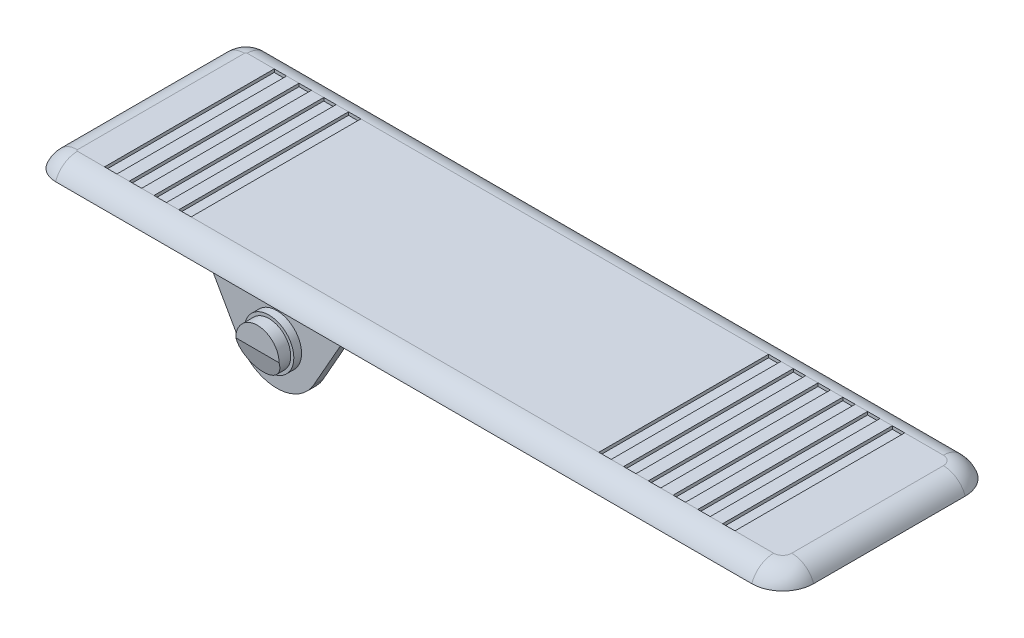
ISO-10303-21;
HEADER;
FILE_DESCRIPTION(('STEP AP214'),'2;1');
FILE_NAME('part.step','',(''),(''),'','','');
FILE_SCHEMA(('AUTOMOTIVE_DESIGN { 1 0 10303 214 1 1 1 1 }'));
ENDSEC;
DATA;
#1=APPLICATION_CONTEXT('core data for automotive mechanical design processes');
#2=APPLICATION_PROTOCOL_DEFINITION('international standard','automotive_design',2000,#1);
#3=PRODUCT_CONTEXT('',#1,'mechanical');
#4=PRODUCT('Part','Part','',(#3));
#5=PRODUCT_RELATED_PRODUCT_CATEGORY('part','',(#4));
#6=PRODUCT_DEFINITION_FORMATION('','',#4);
#7=PRODUCT_DEFINITION_CONTEXT('part definition',#1,'design');
#8=PRODUCT_DEFINITION('design','',#6,#7);
#9=PRODUCT_DEFINITION_SHAPE('','',#8);
#10=(LENGTH_UNIT() NAMED_UNIT(*) SI_UNIT(.MILLI.,.METRE.));
#11=(NAMED_UNIT(*) PLANE_ANGLE_UNIT() SI_UNIT($,.RADIAN.));
#12=(NAMED_UNIT(*) SI_UNIT($,.STERADIAN.) SOLID_ANGLE_UNIT());
#13=UNCERTAINTY_MEASURE_WITH_UNIT(LENGTH_MEASURE(1.E-05),#10,'distance_accuracy_value','');
#14=(GEOMETRIC_REPRESENTATION_CONTEXT(3) GLOBAL_UNCERTAINTY_ASSIGNED_CONTEXT((#13)) GLOBAL_UNIT_ASSIGNED_CONTEXT((#10,
#11,#12)) REPRESENTATION_CONTEXT('',''));
#15=CARTESIAN_POINT('',(0.,0.,0.));
#16=DIRECTION('',(0.,0.,1.));
#17=DIRECTION('',(1.,0.,0.));
#18=AXIS2_PLACEMENT_3D('',#15,#16,#17);
#19=CARTESIAN_POINT('',(3.81,2.54,-3.81));
#20=DIRECTION('',(0.,1.,0.));
#21=DIRECTION('',(0.,0.,1.));
#22=AXIS2_PLACEMENT_3D('',#19,#20,#21);
#23=PLANE('',#22);
#24=DIRECTION('',(0.,0.,-1.));
#25=VECTOR('',#24,1.);
#26=CARTESIAN_POINT('',(22.479,2.54,-3.59210244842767));
#27=LINE('',#26,#25);
#28=CARTESIAN_POINT('',(22.479,2.54,-3.59210244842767));
#29=VERTEX_POINT('',#28);
#30=CARTESIAN_POINT('',(22.479,2.54,-31.4598975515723));
#31=VERTEX_POINT('',#30);
#32=EDGE_CURVE('E43',#29,#31,#27,.T.);
#33=ORIENTED_EDGE('',*,*,#32,.F.);
#34=DIRECTION('',(-1.,0.,0.));
#35=VECTOR('',#34,1.);
#36=CARTESIAN_POINT('',(118.11,2.54,-3.59210244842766));
#37=LINE('',#36,#35);
#38=CARTESIAN_POINT('',(89.408,2.54,-3.59210244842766));
#39=VERTEX_POINT('',#38);
#40=EDGE_CURVE('E975',#29,#39,#37,.F.);
#41=ORIENTED_EDGE('',*,*,#40,.T.);
#42=DIRECTION('',(0.,0.,1.));
#43=VECTOR('',#42,1.);
#44=CARTESIAN_POINT('',(89.408,2.54,-31.4598975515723));
#45=LINE('',#44,#43);
#46=CARTESIAN_POINT('',(89.408,2.54,-31.4598975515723));
#47=VERTEX_POINT('',#46);
#48=EDGE_CURVE('E587',#47,#39,#45,.T.);
#49=ORIENTED_EDGE('',*,*,#48,.F.);
#50=DIRECTION('',(1.,0.,0.));
#51=VECTOR('',#50,1.);
#52=CARTESIAN_POINT('',(3.80999999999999,2.54,-31.4598975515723));
#53=LINE('',#52,#51);
#54=EDGE_CURVE('E529',#47,#31,#53,.F.);
#55=ORIENTED_EDGE('',*,*,#54,.T.);
#56=EDGE_LOOP('',(#33,#41,#49,#55));
#57=FACE_BOUND('',#56,.T.);
#58=ADVANCED_FACE('F28',(#57),#23,.T.);
#59=DIRECTION('',(0.,0.,1.));
#60=VECTOR('',#59,1.);
#61=CARTESIAN_POINT('',(20.447,2.54,-31.4598975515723));
#62=LINE('',#61,#60);
#63=CARTESIAN_POINT('',(20.447,2.54,-31.4598975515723));
#64=VERTEX_POINT('',#63);
#65=CARTESIAN_POINT('',(20.447,2.54,-3.59210244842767));
#66=VERTEX_POINT('',#65);
#67=EDGE_CURVE('E502',#64,#66,#62,.T.);
#68=ORIENTED_EDGE('',*,*,#67,.F.);
#69=CARTESIAN_POINT('',(18.415,2.54,-31.4598975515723));
#70=VERTEX_POINT('',#69);
#71=EDGE_CURVE('E51',#64,#70,#53,.F.);
#72=ORIENTED_EDGE('',*,*,#71,.T.);
#73=DIRECTION('',(0.,0.,-1.));
#74=VECTOR('',#73,1.);
#75=CARTESIAN_POINT('',(18.415,2.54,-3.59210244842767));
#76=LINE('',#75,#74);
#77=CARTESIAN_POINT('',(18.415,2.54,-3.59210244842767));
#78=VERTEX_POINT('',#77);
#79=EDGE_CURVE('E1776',#78,#70,#76,.T.);
#80=ORIENTED_EDGE('',*,*,#79,.F.);
#81=EDGE_CURVE('E521',#78,#66,#37,.F.);
#82=ORIENTED_EDGE('',*,*,#81,.T.);
#83=EDGE_LOOP('',(#68,#72,#80,#82));
#84=FACE_BOUND('',#83,.T.);
#85=ADVANCED_FACE('F519',(#84),#23,.T.);
#86=DIRECTION('',(0.,0.,1.));
#87=VECTOR('',#86,1.);
#88=CARTESIAN_POINT('',(16.383,2.54,-31.4598975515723));
#89=LINE('',#88,#87);
#90=CARTESIAN_POINT('',(16.383,2.54,-31.4598975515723));
#91=VERTEX_POINT('',#90);
#92=CARTESIAN_POINT('',(16.383,2.54,-3.59210244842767));
#93=VERTEX_POINT('',#92);
#94=EDGE_CURVE('E1093',#91,#93,#89,.T.);
#95=ORIENTED_EDGE('',*,*,#94,.F.);
#96=CARTESIAN_POINT('',(14.351,2.54,-31.4598975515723));
#97=VERTEX_POINT('',#96);
#98=EDGE_CURVE('E530',#91,#97,#53,.F.);
#99=ORIENTED_EDGE('',*,*,#98,.T.);
#100=DIRECTION('',(0.,0.,-1.));
#101=VECTOR('',#100,1.);
#102=CARTESIAN_POINT('',(14.351,2.54,-3.59210244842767));
#103=LINE('',#102,#101);
#104=CARTESIAN_POINT('',(14.351,2.54,-3.59210244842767));
#105=VERTEX_POINT('',#104);
#106=EDGE_CURVE('E1095',#105,#97,#103,.T.);
#107=ORIENTED_EDGE('',*,*,#106,.F.);
#108=EDGE_CURVE('E1085',#105,#93,#37,.F.);
#109=ORIENTED_EDGE('',*,*,#108,.T.);
#110=EDGE_LOOP('',(#95,#99,#107,#109));
#111=FACE_BOUND('',#110,.T.);
#112=ADVANCED_FACE('F1091',(#111),#23,.T.);
#113=DIRECTION('',(0.,0.,1.));
#114=VECTOR('',#113,1.);
#115=CARTESIAN_POINT('',(12.319,2.54,-31.4598975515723));
#116=LINE('',#115,#114);
#117=CARTESIAN_POINT('',(12.319,2.54,-31.4598975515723));
#118=VERTEX_POINT('',#117);
#119=CARTESIAN_POINT('',(12.319,2.54,-3.59210244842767));
#120=VERTEX_POINT('',#119);
#121=EDGE_CURVE('E1000',#118,#120,#116,.T.);
#122=ORIENTED_EDGE('',*,*,#121,.F.);
#123=CARTESIAN_POINT('',(10.287,2.54,-31.4598975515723));
#124=VERTEX_POINT('',#123);
#125=EDGE_CURVE('E535',#118,#124,#53,.F.);
#126=ORIENTED_EDGE('',*,*,#125,.T.);
#127=DIRECTION('',(0.,0.,-1.));
#128=VECTOR('',#127,1.);
#129=CARTESIAN_POINT('',(10.287,2.54,-3.59210244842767));
#130=LINE('',#129,#128);
#131=CARTESIAN_POINT('',(10.287,2.54,-3.59210244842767));
#132=VERTEX_POINT('',#131);
#133=EDGE_CURVE('E997',#132,#124,#130,.T.);
#134=ORIENTED_EDGE('',*,*,#133,.F.);
#135=EDGE_CURVE('E974',#132,#120,#37,.F.);
#136=ORIENTED_EDGE('',*,*,#135,.T.);
#137=EDGE_LOOP('',(#122,#126,#134,#136));
#138=FACE_BOUND('',#137,.T.);
#139=ADVANCED_FACE('F995',(#138),#23,.T.);
#140=DIRECTION('',(0.,0.,-1.));
#141=VECTOR('',#140,1.);
#142=CARTESIAN_POINT('',(91.44,2.54,-3.59210244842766));
#143=LINE('',#142,#141);
#144=CARTESIAN_POINT('',(91.44,2.54,-3.59210244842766));
#145=VERTEX_POINT('',#144);
#146=CARTESIAN_POINT('',(91.44,2.54,-31.4598975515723));
#147=VERTEX_POINT('',#146);
#148=EDGE_CURVE('E574',#145,#147,#143,.T.);
#149=ORIENTED_EDGE('',*,*,#148,.F.);
#150=CARTESIAN_POINT('',(93.472,2.54,-3.59210244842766));
#151=VERTEX_POINT('',#150);
#152=EDGE_CURVE('E1083',#145,#151,#37,.F.);
#153=ORIENTED_EDGE('',*,*,#152,.T.);
#154=DIRECTION('',(0.,0.,1.));
#155=VECTOR('',#154,1.);
#156=CARTESIAN_POINT('',(93.472,2.54,-31.4598975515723));
#157=LINE('',#156,#155);
#158=CARTESIAN_POINT('',(93.472,2.54,-31.4598975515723));
#159=VERTEX_POINT('',#158);
#160=EDGE_CURVE('E577',#159,#151,#157,.T.);
#161=ORIENTED_EDGE('',*,*,#160,.F.);
#162=EDGE_CURVE('E533',#159,#147,#53,.F.);
#163=ORIENTED_EDGE('',*,*,#162,.T.);
#164=EDGE_LOOP('',(#149,#153,#161,#163));
#165=FACE_BOUND('',#164,.T.);
#166=ADVANCED_FACE('F573',(#165),#23,.T.);
#167=DIRECTION('',(0.,0.,-1.));
#168=VECTOR('',#167,1.);
#169=CARTESIAN_POINT('',(95.504,2.54,-3.59210244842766));
#170=LINE('',#169,#168);
#171=CARTESIAN_POINT('',(95.504,2.54,-3.59210244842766));
#172=VERTEX_POINT('',#171);
#173=CARTESIAN_POINT('',(95.504,2.54,-31.4598975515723));
#174=VERTEX_POINT('',#173);
#175=EDGE_CURVE('E611',#172,#174,#170,.T.);
#176=ORIENTED_EDGE('',*,*,#175,.F.);
#177=CARTESIAN_POINT('',(97.536,2.54,-3.59210244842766));
#178=VERTEX_POINT('',#177);
#179=EDGE_CURVE('E1081',#172,#178,#37,.F.);
#180=ORIENTED_EDGE('',*,*,#179,.T.);
#181=DIRECTION('',(0.,0.,1.));
#182=VECTOR('',#181,1.);
#183=CARTESIAN_POINT('',(97.536,2.54,-31.4598975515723));
#184=LINE('',#183,#182);
#185=CARTESIAN_POINT('',(97.536,2.54,-31.4598975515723));
#186=VERTEX_POINT('',#185);
#187=EDGE_CURVE('E649',#186,#178,#184,.T.);
#188=ORIENTED_EDGE('',*,*,#187,.F.);
#189=EDGE_CURVE('E558',#186,#174,#53,.F.);
#190=ORIENTED_EDGE('',*,*,#189,.T.);
#191=EDGE_LOOP('',(#176,#180,#188,#190));
#192=FACE_BOUND('',#191,.T.);
#193=ADVANCED_FACE('F1882',(#192),#23,.T.);
#194=DIRECTION('',(0.,0.,-1.));
#195=VECTOR('',#194,1.);
#196=CARTESIAN_POINT('',(99.568,2.54,-3.59210244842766));
#197=LINE('',#196,#195);
#198=CARTESIAN_POINT('',(99.568,2.54,-3.59210244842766));
#199=VERTEX_POINT('',#198);
#200=CARTESIAN_POINT('',(99.568,2.54,-31.4598975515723));
#201=VERTEX_POINT('',#200);
#202=EDGE_CURVE('E637',#199,#201,#197,.T.);
#203=ORIENTED_EDGE('',*,*,#202,.F.);
#204=CARTESIAN_POINT('',(101.6,2.54,-3.59210244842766));
#205=VERTEX_POINT('',#204);
#206=EDGE_CURVE('E1079',#199,#205,#37,.F.);
#207=ORIENTED_EDGE('',*,*,#206,.T.);
#208=DIRECTION('',(0.,0.,1.));
#209=VECTOR('',#208,1.);
#210=CARTESIAN_POINT('',(101.6,2.54,-31.4598975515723));
#211=LINE('',#210,#209);
#212=CARTESIAN_POINT('',(101.6,2.54,-31.4598975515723));
#213=VERTEX_POINT('',#212);
#214=EDGE_CURVE('E680',#213,#205,#211,.T.);
#215=ORIENTED_EDGE('',*,*,#214,.F.);
#216=EDGE_CURVE('E552',#213,#201,#53,.F.);
#217=ORIENTED_EDGE('',*,*,#216,.T.);
#218=EDGE_LOOP('',(#203,#207,#215,#217));
#219=FACE_BOUND('',#218,.T.);
#220=ADVANCED_FACE('F1209',(#219),#23,.T.);
#221=DIRECTION('',(0.,0.,-1.));
#222=VECTOR('',#221,1.);
#223=CARTESIAN_POINT('',(103.632,2.54,-3.59210244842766));
#224=LINE('',#223,#222);
#225=CARTESIAN_POINT('',(103.632,2.54,-3.59210244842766));
#226=VERTEX_POINT('',#225);
#227=CARTESIAN_POINT('',(103.632,2.54,-31.4598975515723));
#228=VERTEX_POINT('',#227);
#229=EDGE_CURVE('E668',#226,#228,#224,.T.);
#230=ORIENTED_EDGE('',*,*,#229,.F.);
#231=CARTESIAN_POINT('',(105.664,2.54,-3.59210244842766));
#232=VERTEX_POINT('',#231);
#233=EDGE_CURVE('E1077',#226,#232,#37,.F.);
#234=ORIENTED_EDGE('',*,*,#233,.T.);
#235=DIRECTION('',(0.,0.,1.));
#236=VECTOR('',#235,1.);
#237=CARTESIAN_POINT('',(105.664,2.54,-31.4598975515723));
#238=LINE('',#237,#236);
#239=CARTESIAN_POINT('',(105.664,2.54,-31.4598975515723));
#240=VERTEX_POINT('',#239);
#241=EDGE_CURVE('E711',#240,#232,#238,.T.);
#242=ORIENTED_EDGE('',*,*,#241,.F.);
#243=EDGE_CURVE('E546',#240,#228,#53,.F.);
#244=ORIENTED_EDGE('',*,*,#243,.T.);
#245=EDGE_LOOP('',(#230,#234,#242,#244));
#246=FACE_BOUND('',#245,.T.);
#247=ADVANCED_FACE('F1204',(#246),#23,.T.);
#248=DIRECTION('',(0.,0.,-1.));
#249=VECTOR('',#248,1.);
#250=CARTESIAN_POINT('',(107.696,2.54,-3.59210244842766));
#251=LINE('',#250,#249);
#252=CARTESIAN_POINT('',(107.696,2.54,-3.59210244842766));
#253=VERTEX_POINT('',#252);
#254=CARTESIAN_POINT('',(107.696,2.54,-31.4598975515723));
#255=VERTEX_POINT('',#254);
#256=EDGE_CURVE('E699',#253,#255,#251,.T.);
#257=ORIENTED_EDGE('',*,*,#256,.F.);
#258=CARTESIAN_POINT('',(109.728,2.54,-3.59210244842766));
#259=VERTEX_POINT('',#258);
#260=EDGE_CURVE('E1076',#253,#259,#37,.F.);
#261=ORIENTED_EDGE('',*,*,#260,.T.);
#262=DIRECTION('',(0.,0.,1.));
#263=VECTOR('',#262,1.);
#264=CARTESIAN_POINT('',(109.728,2.54,-31.4598975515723));
#265=LINE('',#264,#263);
#266=CARTESIAN_POINT('',(109.728,2.54,-31.4598975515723));
#267=VERTEX_POINT('',#266);
#268=EDGE_CURVE('E742',#267,#259,#265,.T.);
#269=ORIENTED_EDGE('',*,*,#268,.F.);
#270=EDGE_CURVE('E540',#267,#255,#53,.F.);
#271=ORIENTED_EDGE('',*,*,#270,.T.);
#272=EDGE_LOOP('',(#257,#261,#269,#271));
#273=FACE_BOUND('',#272,.T.);
#274=ADVANCED_FACE('F1194',(#273),#23,.T.);
#275=DIRECTION('',(0.,0.,-1.));
#276=VECTOR('',#275,1.);
#277=CARTESIAN_POINT('',(111.76,2.54,-3.59210244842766));
#278=LINE('',#277,#276);
#279=CARTESIAN_POINT('',(111.76,2.54,-3.59210244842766));
#280=VERTEX_POINT('',#279);
#281=CARTESIAN_POINT('',(111.76,2.54,-31.4598975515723));
#282=VERTEX_POINT('',#281);
#283=EDGE_CURVE('E730',#280,#282,#278,.T.);
#284=ORIENTED_EDGE('',*,*,#283,.F.);
#285=CARTESIAN_POINT('',(118.11,2.54,-3.59210244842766));
#286=VERTEX_POINT('',#285);
#287=EDGE_CURVE('E969',#280,#286,#37,.F.);
#288=ORIENTED_EDGE('',*,*,#287,.T.);
#289=CARTESIAN_POINT('',(118.11,2.54,-5.08));
#290=DIRECTION('',(0.,1.,0.));
#291=DIRECTION('',(0.,0.,1.));
#292=AXIS2_PLACEMENT_3D('',#289,#290,#291);
#293=CIRCLE('',#292,1.48789755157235);
#294=CARTESIAN_POINT('',(119.597897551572,2.54,-5.08));
#295=VERTEX_POINT('',#294);
#296=EDGE_CURVE('E973',#286,#295,#293,.T.);
#297=ORIENTED_EDGE('',*,*,#296,.T.);
#298=DIRECTION('',(0.,0.,-1.));
#299=VECTOR('',#298,1.);
#300=CARTESIAN_POINT('',(119.597897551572,2.54,-29.972));
#301=LINE('',#300,#299);
#302=CARTESIAN_POINT('',(119.597897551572,2.54,-29.972));
#303=VERTEX_POINT('',#302);
#304=EDGE_CURVE('E979',#295,#303,#301,.T.);
#305=ORIENTED_EDGE('',*,*,#304,.T.);
#306=CARTESIAN_POINT('',(118.11,2.54,-29.972));
#307=DIRECTION('',(0.,1.,0.));
#308=DIRECTION('',(0.,0.,1.));
#309=AXIS2_PLACEMENT_3D('',#306,#307,#308);
#310=CIRCLE('',#309,1.48789755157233);
#311=CARTESIAN_POINT('',(118.11,2.54,-31.4598975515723));
#312=VERTEX_POINT('',#311);
#313=EDGE_CURVE('E983',#303,#312,#310,.T.);
#314=ORIENTED_EDGE('',*,*,#313,.T.);
#315=EDGE_CURVE('E532',#312,#282,#53,.F.);
#316=ORIENTED_EDGE('',*,*,#315,.T.);
#317=EDGE_LOOP('',(#284,#288,#297,#305,#314,#316));
#318=FACE_BOUND('',#317,.T.);
#319=ADVANCED_FACE('F1074',(#318),#23,.T.);
#320=CARTESIAN_POINT('',(3.81,0.,-3.81));
#321=DIRECTION('',(0.,1.,0.));
#322=DIRECTION('',(0.,0.,1.));
#323=AXIS2_PLACEMENT_3D('',#320,#321,#322);
#324=PLANE('',#323);
#325=DIRECTION('',(0.,0.,1.));
#326=VECTOR('',#325,1.);
#327=CARTESIAN_POINT('',(119.634,0.,-30.988));
#328=LINE('',#327,#326);
#329=CARTESIAN_POINT('',(119.634,0.,-30.988));
#330=VERTEX_POINT('',#329);
#331=CARTESIAN_POINT('',(119.634,0.,-4.064));
#332=VERTEX_POINT('',#331);
#333=EDGE_CURVE('E790',#330,#332,#328,.T.);
#334=ORIENTED_EDGE('',*,*,#333,.F.);
#335=CARTESIAN_POINT('',(118.872,0.,-30.988));
#336=DIRECTION('',(0.,1.,0.));
#337=DIRECTION('',(0.,0.,1.));
#338=AXIS2_PLACEMENT_3D('',#335,#336,#337);
#339=CIRCLE('',#338,0.761999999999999);
#340=CARTESIAN_POINT('',(118.11,0.,-30.988));
#341=VERTEX_POINT('',#340);
#342=EDGE_CURVE('E799',#330,#341,#339,.T.);
#343=ORIENTED_EDGE('',*,*,#342,.T.);
#344=DIRECTION('',(0.,0.,-1.));
#345=VECTOR('',#344,1.);
#346=CARTESIAN_POINT('',(118.11,0.,-4.064));
#347=LINE('',#346,#345);
#348=CARTESIAN_POINT('',(118.11,0.,-4.064));
#349=VERTEX_POINT('',#348);
#350=EDGE_CURVE('E800',#349,#341,#347,.T.);
#351=ORIENTED_EDGE('',*,*,#350,.F.);
#352=CARTESIAN_POINT('',(118.872,0.,-4.064));
#353=DIRECTION('',(0.,1.,0.));
#354=DIRECTION('',(0.,0.,1.));
#355=AXIS2_PLACEMENT_3D('',#352,#353,#354);
#356=CIRCLE('',#355,0.761999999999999);
#357=EDGE_CURVE('E795',#349,#332,#356,.T.);
#358=ORIENTED_EDGE('',*,*,#357,.T.);
#359=EDGE_LOOP('',(#334,#343,#351,#358));
#360=FACE_BOUND('',#359,.T.);
#361=DIRECTION('',(1.,0.,0.));
#362=VECTOR('',#361,1.);
#363=CARTESIAN_POINT('',(5.08,0.,-31.75));
#364=LINE('',#363,#362);
#365=CARTESIAN_POINT('',(5.842,0.,-31.75));
#366=VERTEX_POINT('',#365);
#367=CARTESIAN_POINT('',(110.236,0.,-31.75));
#368=VERTEX_POINT('',#367);
#369=EDGE_CURVE('E826',#366,#368,#364,.T.);
#370=ORIENTED_EDGE('',*,*,#369,.F.);
#371=CARTESIAN_POINT('',(5.842,0.,-30.988));
#372=DIRECTION('',(0.,1.,0.));
#373=DIRECTION('',(0.,0.,1.));
#374=AXIS2_PLACEMENT_3D('',#371,#372,#373);
#375=CIRCLE('',#374,0.762);
#376=CARTESIAN_POINT('',(5.08,0.,-30.988));
#377=VERTEX_POINT('',#376);
#378=EDGE_CURVE('E2144',#366,#377,#375,.T.);
#379=ORIENTED_EDGE('',*,*,#378,.T.);
#380=CARTESIAN_POINT('',(5.842,0.,-30.988));
#381=DIRECTION('',(0.,1.,0.));
#382=DIRECTION('',(0.,0.,1.));
#383=AXIS2_PLACEMENT_3D('',#380,#381,#382);
#384=CIRCLE('',#383,0.762);
#385=CARTESIAN_POINT('',(5.842,0.,-30.226));
#386=VERTEX_POINT('',#385);
#387=EDGE_CURVE('E2142',#377,#386,#384,.T.);
#388=ORIENTED_EDGE('',*,*,#387,.T.);
#389=DIRECTION('',(1.,0.,0.));
#390=VECTOR('',#389,1.);
#391=CARTESIAN_POINT('',(5.08,0.,-30.226));
#392=LINE('',#391,#390);
#393=CARTESIAN_POINT('',(110.236,0.,-30.226));
#394=VERTEX_POINT('',#393);
#395=EDGE_CURVE('E842',#386,#394,#392,.T.);
#396=ORIENTED_EDGE('',*,*,#395,.T.);
#397=CARTESIAN_POINT('',(110.236,0.,-30.988));
#398=DIRECTION('',(0.,1.,0.));
#399=DIRECTION('',(0.,0.,1.));
#400=AXIS2_PLACEMENT_3D('',#397,#398,#399);
#401=CIRCLE('',#400,0.762);
#402=CARTESIAN_POINT('',(110.998,0.,-30.988));
#403=VERTEX_POINT('',#402);
#404=EDGE_CURVE('E2148',#394,#403,#401,.T.);
#405=ORIENTED_EDGE('',*,*,#404,.T.);
#406=CARTESIAN_POINT('',(110.236,0.,-30.988));
#407=DIRECTION('',(0.,1.,0.));
#408=DIRECTION('',(0.,0.,1.));
#409=AXIS2_PLACEMENT_3D('',#406,#407,#408);
#410=CIRCLE('',#409,0.762);
#411=EDGE_CURVE('E2146',#403,#368,#410,.T.);
#412=ORIENTED_EDGE('',*,*,#411,.T.);
#413=EDGE_LOOP('',(#370,#379,#388,#396,#405,#412));
#414=FACE_BOUND('',#413,.T.);
#415=CARTESIAN_POINT('',(110.236,0.,-4.064));
#416=DIRECTION('',(0.,1.,0.));
#417=DIRECTION('',(0.,0.,1.));
#418=AXIS2_PLACEMENT_3D('',#415,#416,#417);
#419=CIRCLE('',#418,0.762);
#420=CARTESIAN_POINT('',(110.236,0.,-3.302));
#421=VERTEX_POINT('',#420);
#422=CARTESIAN_POINT('',(110.998,0.,-4.064));
#423=VERTEX_POINT('',#422);
#424=EDGE_CURVE('E2112',#421,#423,#419,.T.);
#425=ORIENTED_EDGE('',*,*,#424,.T.);
#426=CARTESIAN_POINT('',(110.236,0.,-4.064));
#427=DIRECTION('',(0.,1.,0.));
#428=DIRECTION('',(0.,0.,1.));
#429=AXIS2_PLACEMENT_3D('',#426,#427,#428);
#430=CIRCLE('',#429,0.762);
#431=CARTESIAN_POINT('',(110.236,0.,-4.826));
#432=VERTEX_POINT('',#431);
#433=EDGE_CURVE('E2114',#423,#432,#430,.T.);
#434=ORIENTED_EDGE('',*,*,#433,.T.);
#435=DIRECTION('',(1.,0.,0.));
#436=VECTOR('',#435,1.);
#437=CARTESIAN_POINT('',(5.08,0.,-4.826));
#438=LINE('',#437,#436);
#439=CARTESIAN_POINT('',(5.842,0.,-4.826));
#440=VERTEX_POINT('',#439);
#441=EDGE_CURVE('E912',#440,#432,#438,.T.);
#442=ORIENTED_EDGE('',*,*,#441,.F.);
#443=CARTESIAN_POINT('',(5.842,0.,-4.064));
#444=DIRECTION('',(0.,1.,0.));
#445=DIRECTION('',(0.,0.,1.));
#446=AXIS2_PLACEMENT_3D('',#443,#444,#445);
#447=CIRCLE('',#446,0.762);
#448=CARTESIAN_POINT('',(5.08,0.,-4.064));
#449=VERTEX_POINT('',#448);
#450=EDGE_CURVE('E2109',#440,#449,#447,.T.);
#451=ORIENTED_EDGE('',*,*,#450,.T.);
#452=CARTESIAN_POINT('',(5.842,0.,-4.064));
#453=DIRECTION('',(0.,1.,0.));
#454=DIRECTION('',(0.,0.,1.));
#455=AXIS2_PLACEMENT_3D('',#452,#453,#454);
#456=CIRCLE('',#455,0.762);
#457=CARTESIAN_POINT('',(5.842,0.,-3.302));
#458=VERTEX_POINT('',#457);
#459=EDGE_CURVE('E2091',#449,#458,#456,.T.);
#460=ORIENTED_EDGE('',*,*,#459,.T.);
#461=DIRECTION('',(1.,0.,0.));
#462=VECTOR('',#461,1.);
#463=CARTESIAN_POINT('',(5.08,0.,-3.302));
#464=LINE('',#463,#462);
#465=EDGE_CURVE('E896',#458,#421,#464,.T.);
#466=ORIENTED_EDGE('',*,*,#465,.T.);
#467=EDGE_LOOP('',(#425,#434,#442,#451,#460,#466));
#468=FACE_BOUND('',#467,.T.);
#469=CARTESIAN_POINT('',(3.81,0.,-3.81));
#470=DIRECTION('',(0.,1.,0.));
#471=DIRECTION('',(0.,0.,1.));
#472=AXIS2_PLACEMENT_3D('',#469,#470,#471);
#473=CIRCLE('',#472,3.81);
#474=CARTESIAN_POINT('',(0.,0.,-3.81000000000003));
#475=VERTEX_POINT('',#474);
#476=CARTESIAN_POINT('',(3.81000000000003,0.,0.));
#477=VERTEX_POINT('',#476);
#478=EDGE_CURVE('E948',#475,#477,#473,.T.);
#479=ORIENTED_EDGE('',*,*,#478,.F.);
#480=DIRECTION('',(0.,0.,-1.));
#481=VECTOR('',#480,1.);
#482=CARTESIAN_POINT('',(0.,0.,-3.81000000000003));
#483=LINE('',#482,#481);
#484=CARTESIAN_POINT('',(0.,0.,-31.242));
#485=VERTEX_POINT('',#484);
#486=EDGE_CURVE('E967',#475,#485,#483,.T.);
#487=ORIENTED_EDGE('',*,*,#486,.T.);
#488=CARTESIAN_POINT('',(3.81,0.,-31.242));
#489=DIRECTION('',(0.,1.,0.));
#490=DIRECTION('',(0.,0.,1.));
#491=AXIS2_PLACEMENT_3D('',#488,#489,#490);
#492=CIRCLE('',#491,3.81);
#493=CARTESIAN_POINT('',(3.81,0.,-35.052));
#494=VERTEX_POINT('',#493);
#495=EDGE_CURVE('E964',#494,#485,#492,.T.);
#496=ORIENTED_EDGE('',*,*,#495,.F.);
#497=DIRECTION('',(-1.,0.,0.));
#498=VECTOR('',#497,1.);
#499=CARTESIAN_POINT('',(118.11,0.,-35.052));
#500=LINE('',#499,#498);
#501=CARTESIAN_POINT('',(118.11,0.,-35.052));
#502=VERTEX_POINT('',#501);
#503=EDGE_CURVE('E961',#502,#494,#500,.T.);
#504=ORIENTED_EDGE('',*,*,#503,.F.);
#505=CARTESIAN_POINT('',(118.11,0.,-29.972));
#506=DIRECTION('',(0.,1.,0.));
#507=DIRECTION('',(0.,0.,1.));
#508=AXIS2_PLACEMENT_3D('',#505,#506,#507);
#509=CIRCLE('',#508,5.07999999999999);
#510=CARTESIAN_POINT('',(123.19,0.,-29.972));
#511=VERTEX_POINT('',#510);
#512=EDGE_CURVE('E958',#511,#502,#509,.T.);
#513=ORIENTED_EDGE('',*,*,#512,.F.);
#514=DIRECTION('',(0.,0.,1.));
#515=VECTOR('',#514,1.);
#516=CARTESIAN_POINT('',(123.19,0.,-29.972));
#517=LINE('',#516,#515);
#518=CARTESIAN_POINT('',(123.19,0.,-5.08));
#519=VERTEX_POINT('',#518);
#520=EDGE_CURVE('E956',#511,#519,#517,.T.);
#521=ORIENTED_EDGE('',*,*,#520,.T.);
#522=CARTESIAN_POINT('',(118.11,0.,-5.08));
#523=DIRECTION('',(0.,-1.,0.));
#524=DIRECTION('',(0.,0.,-1.));
#525=AXIS2_PLACEMENT_3D('',#522,#523,#524);
#526=CIRCLE('',#525,5.08000000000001);
#527=CARTESIAN_POINT('',(118.11,0.,0.));
#528=VERTEX_POINT('',#527);
#529=EDGE_CURVE('E954',#519,#528,#526,.T.);
#530=ORIENTED_EDGE('',*,*,#529,.T.);
#531=DIRECTION('',(1.,0.,0.));
#532=VECTOR('',#531,1.);
#533=CARTESIAN_POINT('',(3.81000000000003,0.,0.));
#534=LINE('',#533,#532);
#535=EDGE_CURVE('E951',#477,#528,#534,.T.);
#536=ORIENTED_EDGE('',*,*,#535,.F.);
#537=EDGE_LOOP('',(#479,#487,#496,#504,#513,#521,#530,#536));
#538=FACE_BOUND('',#537,.T.);
#539=CARTESIAN_POINT('',(14.605,0.,-17.526));
#540=DIRECTION('',(0.,1.,0.));
#541=DIRECTION('',(0.,0.,1.));
#542=AXIS2_PLACEMENT_3D('',#539,#540,#541);
#543=CIRCLE('',#542,9.271);
#544=CARTESIAN_POINT('',(14.605,0.,-8.25500000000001));
#545=VERTEX_POINT('',#544);
#546=EDGE_CURVE('E11',#545,#545,#543,.F.);
#547=ORIENTED_EDGE('',*,*,#546,.F.);
#548=EDGE_LOOP('',(#547));
#549=FACE_BOUND('',#548,.T.);
#550=ADVANCED_FACE('F1063',(#360,#414,#468,#538,#549),#324,.F.);
#551=CARTESIAN_POINT('',(36.83,-7.5184,-0.127));
#552=DIRECTION('',(0.,0.,-1.));
#553=DIRECTION('',(-1.,0.,0.));
#554=AXIS2_PLACEMENT_3D('',#551,#552,#553);
#555=CYLINDRICAL_SURFACE('',#554,3.55600000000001);
#556=CARTESIAN_POINT('',(36.83,-7.5184,-2.032));
#557=DIRECTION('',(0.,0.,1.));
#558=DIRECTION('',(1.,0.,0.));
#559=AXIS2_PLACEMENT_3D('',#556,#557,#558);
#560=CIRCLE('',#559,3.55600000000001);
#561=CARTESIAN_POINT('',(40.386,-7.5184,-2.032));
#562=VERTEX_POINT('',#561);
#563=EDGE_CURVE('E873',#562,#562,#560,.F.);
#564=ORIENTED_EDGE('',*,*,#563,.F.);
#565=EDGE_LOOP('',(#564));
#566=FACE_BOUND('',#565,.T.);
#567=CARTESIAN_POINT('',(36.83,-7.5184,-0.127));
#568=DIRECTION('',(0.,0.,1.));
#569=DIRECTION('',(1.,0.,0.));
#570=AXIS2_PLACEMENT_3D('',#567,#568,#569);
#571=CIRCLE('',#570,3.55600000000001);
#572=CARTESIAN_POINT('',(40.386,-7.5184,-0.127));
#573=VERTEX_POINT('',#572);
#574=CARTESIAN_POINT('',(33.274,-7.5184,-0.127));
#575=VERTEX_POINT('',#574);
#576=EDGE_CURVE('E870',#573,#575,#571,.T.);
#577=ORIENTED_EDGE('',*,*,#576,.F.);
#578=CARTESIAN_POINT('',(36.83,-7.5184,-0.127));
#579=DIRECTION('',(0.,-0.258736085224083,0.965948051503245));
#580=DIRECTION('',(0.,-0.965948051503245,-0.258736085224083));
#581=AXIS2_PLACEMENT_3D('',#578,#579,#580);
#582=ELLIPSE('',#581,3.68135739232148,3.55600000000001);
#583=EDGE_CURVE('E862',#575,#573,#582,.T.);
#584=ORIENTED_EDGE('',*,*,#583,.F.);
#585=EDGE_LOOP('',(#577,#584));
#586=FACE_BOUND('',#585,.T.);
#587=ADVANCED_FACE('F1200',(#566,#586),#555,.T.);
#588=CARTESIAN_POINT('',(36.83,-7.5184,-0.127));
#589=DIRECTION('',(0.,0.,1.));
#590=DIRECTION('',(1.,0.,0.));
#591=AXIS2_PLACEMENT_3D('',#588,#589,#590);
#592=PLANE('',#591);
#593=ORIENTED_EDGE('',*,*,#576,.T.);
#594=DIRECTION('',(1.,0.,0.));
#595=VECTOR('',#594,1.);
#596=CARTESIAN_POINT('',(36.83,-7.5184,-0.127));
#597=LINE('',#596,#595);
#598=EDGE_CURVE('E2119',#575,#573,#597,.T.);
#599=ORIENTED_EDGE('',*,*,#598,.T.);
#600=EDGE_LOOP('',(#593,#599));
#601=FACE_BOUND('',#600,.T.);
#602=ADVANCED_FACE('F1377',(#601),#592,.T.);
#603=CARTESIAN_POINT('',(36.83,-7.5184,-2.032));
#604=DIRECTION('',(0.,0.,1.));
#605=DIRECTION('',(1.,0.,0.));
#606=AXIS2_PLACEMENT_3D('',#603,#604,#605);
#607=PLANE('',#606);
#608=CARTESIAN_POINT('',(36.83,-7.5184,-2.032));
#609=DIRECTION('',(0.,0.,1.));
#610=DIRECTION('',(1.,0.,0.));
#611=AXIS2_PLACEMENT_3D('',#608,#609,#610);
#612=CIRCLE('',#611,4.064);
#613=CARTESIAN_POINT('',(40.894,-7.5184,-2.032));
#614=VERTEX_POINT('',#613);
#615=EDGE_CURVE('E874',#614,#614,#612,.T.);
#616=ORIENTED_EDGE('',*,*,#615,.T.);
#617=EDGE_LOOP('',(#616));
#618=FACE_BOUND('',#617,.T.);
#619=ORIENTED_EDGE('',*,*,#563,.T.);
#620=EDGE_LOOP('',(#619));
#621=FACE_BOUND('',#620,.T.);
#622=ADVANCED_FACE('F1190',(#618,#621),#607,.T.);
#623=CARTESIAN_POINT('',(36.83,-7.5184,-3.302));
#624=DIRECTION('',(0.,0.,-1.));
#625=DIRECTION('',(-1.,0.,0.));
#626=AXIS2_PLACEMENT_3D('',#623,#624,#625);
#627=PLANE('',#626);
#628=ORIENTED_EDGE('',*,*,#465,.F.);
#629=DIRECTION('',(0.,-1.,0.));
#630=VECTOR('',#629,1.);
#631=CARTESIAN_POINT('',(5.842,-1.524,-3.302));
#632=LINE('',#631,#630);
#633=CARTESIAN_POINT('',(5.842,-1.524,-3.302));
#634=VERTEX_POINT('',#633);
#635=EDGE_CURVE('E2103',#458,#634,#632,.T.);
#636=ORIENTED_EDGE('',*,*,#635,.T.);
#637=DIRECTION('',(1.,0.,0.));
#638=VECTOR('',#637,1.);
#639=CARTESIAN_POINT('',(5.08,-1.524,-3.302));
#640=LINE('',#639,#638);
#641=CARTESIAN_POINT('',(25.4,-1.524,-3.302));
#642=VERTEX_POINT('',#641);
#643=EDGE_CURVE('E883',#634,#642,#640,.T.);
#644=ORIENTED_EDGE('',*,*,#643,.T.);
#645=DIRECTION('',(-0.493336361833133,0.869838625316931,0.));
#646=VECTOR('',#645,1.);
#647=CARTESIAN_POINT('',(30.7541772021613,-10.9643544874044,-3.302));
#648=LINE('',#647,#646);
#649=CARTESIAN_POINT('',(30.7541772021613,-10.9643544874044,-3.302));
#650=VERTEX_POINT('',#649);
#651=EDGE_CURVE('E885',#650,#642,#648,.T.);
#652=ORIENTED_EDGE('',*,*,#651,.F.);
#653=CARTESIAN_POINT('',(36.83,-7.5184,-3.302));
#654=DIRECTION('',(0.,0.,-1.));
#655=DIRECTION('',(-1.,0.,0.));
#656=AXIS2_PLACEMENT_3D('',#653,#654,#655);
#657=CIRCLE('',#656,6.98499999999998);
#658=CARTESIAN_POINT('',(42.9058227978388,-10.9643544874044,-3.302));
#659=VERTEX_POINT('',#658);
#660=EDGE_CURVE('E888',#659,#650,#657,.T.);
#661=ORIENTED_EDGE('',*,*,#660,.F.);
#662=DIRECTION('',(0.493336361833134,0.86983862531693,0.));
#663=VECTOR('',#662,1.);
#664=CARTESIAN_POINT('',(42.9058227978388,-10.9643544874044,-3.302));
#665=LINE('',#664,#663);
#666=CARTESIAN_POINT('',(48.26,-1.524,-3.302));
#667=VERTEX_POINT('',#666);
#668=EDGE_CURVE('E890',#659,#667,#665,.T.);
#669=ORIENTED_EDGE('',*,*,#668,.T.);
#670=DIRECTION('',(1.,0.,0.));
#671=VECTOR('',#670,1.);
#672=CARTESIAN_POINT('',(48.26,-1.524,-3.302));
#673=LINE('',#672,#671);
#674=CARTESIAN_POINT('',(110.236,-1.524,-3.302));
#675=VERTEX_POINT('',#674);
#676=EDGE_CURVE('E893',#667,#675,#673,.T.);
#677=ORIENTED_EDGE('',*,*,#676,.T.);
#678=DIRECTION('',(0.,-1.,0.));
#679=VECTOR('',#678,1.);
#680=CARTESIAN_POINT('',(110.236,-7.5184,-3.302));
#681=LINE('',#680,#679);
#682=EDGE_CURVE('E2100',#675,#421,#681,.F.);
#683=ORIENTED_EDGE('',*,*,#682,.T.);
#684=EDGE_LOOP('',(#628,#636,#644,#652,#661,#669,#677,#683));
#685=FACE_BOUND('',#684,.T.);
#686=CARTESIAN_POINT('',(36.83,-7.5184,-3.302));
#687=DIRECTION('',(0.,0.,-1.));
#688=DIRECTION('',(-1.,0.,0.));
#689=AXIS2_PLACEMENT_3D('',#686,#687,#688);
#690=CIRCLE('',#689,4.064);
#691=CARTESIAN_POINT('',(32.766,-7.5184,-3.302));
#692=VERTEX_POINT('',#691);
#693=EDGE_CURVE('E2116',#692,#692,#690,.F.);
#694=ORIENTED_EDGE('',*,*,#693,.F.);
#695=EDGE_LOOP('',(#694));
#696=FACE_BOUND('',#695,.T.);
#697=ADVANCED_FACE('F1182',(#685,#696),#627,.F.);
#698=DIRECTION('',(0.,0.,1.));
#699=VECTOR('',#698,1.);
#700=CARTESIAN_POINT('',(8.255,2.54,-31.4598975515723));
#701=LINE('',#700,#699);
#702=CARTESIAN_POINT('',(8.255,2.54,-31.4598975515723));
#703=VERTEX_POINT('',#702);
#704=CARTESIAN_POINT('',(8.255,2.54,-3.59210244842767));
#705=VERTEX_POINT('',#704);
#706=EDGE_CURVE('E1021',#703,#705,#701,.T.);
#707=ORIENTED_EDGE('',*,*,#706,.F.);
#708=CARTESIAN_POINT('',(3.81,2.54,-31.4598975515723));
#709=VERTEX_POINT('',#708);
#710=EDGE_CURVE('E534',#703,#709,#53,.F.);
#711=ORIENTED_EDGE('',*,*,#710,.T.);
#712=CARTESIAN_POINT('',(3.81,2.54,-31.242));
#713=DIRECTION('',(0.,1.,0.));
#714=DIRECTION('',(0.,0.,1.));
#715=AXIS2_PLACEMENT_3D('',#712,#713,#714);
#716=CIRCLE('',#715,0.217897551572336);
#717=CARTESIAN_POINT('',(3.59210244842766,2.54,-31.242));
#718=VERTEX_POINT('',#717);
#719=EDGE_CURVE('E984',#709,#718,#716,.T.);
#720=ORIENTED_EDGE('',*,*,#719,.T.);
#721=DIRECTION('',(0.,0.,1.));
#722=VECTOR('',#721,1.);
#723=CARTESIAN_POINT('',(3.59210244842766,2.54,-3.81000000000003));
#724=LINE('',#723,#722);
#725=CARTESIAN_POINT('',(3.59210244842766,2.54,-3.81));
#726=VERTEX_POINT('',#725);
#727=EDGE_CURVE('E981',#718,#726,#724,.T.);
#728=ORIENTED_EDGE('',*,*,#727,.T.);
#729=CARTESIAN_POINT('',(3.81,2.54,-3.81));
#730=DIRECTION('',(0.,1.,0.));
#731=DIRECTION('',(0.,0.,1.));
#732=AXIS2_PLACEMENT_3D('',#729,#730,#731);
#733=CIRCLE('',#732,0.217897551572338);
#734=CARTESIAN_POINT('',(3.81000000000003,2.54,-3.59210244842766));
#735=VERTEX_POINT('',#734);
#736=EDGE_CURVE('E977',#726,#735,#733,.T.);
#737=ORIENTED_EDGE('',*,*,#736,.T.);
#738=EDGE_CURVE('E970',#735,#705,#37,.F.);
#739=ORIENTED_EDGE('',*,*,#738,.T.);
#740=EDGE_LOOP('',(#707,#711,#720,#728,#737,#739));
#741=FACE_BOUND('',#740,.T.);
#742=ADVANCED_FACE('F30',(#741),#23,.T.);
#743=CARTESIAN_POINT('',(3.81000000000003,-1.27,-3.59210244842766));
#744=DIRECTION('',(1.,0.,0.));
#745=DIRECTION('',(0.,0.,-1.));
#746=AXIS2_PLACEMENT_3D('',#743,#744,#745);
#747=CYLINDRICAL_SURFACE('',#746,3.81);
#748=CARTESIAN_POINT('',(3.81000000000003,-1.27,-3.59210244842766));
#749=DIRECTION('',(-1.,0.,0.));
#750=DIRECTION('',(0.,0.,1.));
#751=AXIS2_PLACEMENT_3D('',#748,#749,#750);
#752=CIRCLE('',#751,3.81);
#753=EDGE_CURVE('E942',#477,#735,#752,.T.);
#754=ORIENTED_EDGE('',*,*,#753,.F.);
#755=ORIENTED_EDGE('',*,*,#535,.T.);
#756=CARTESIAN_POINT('',(118.11,-1.27,-3.59210244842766));
#757=DIRECTION('',(1.,0.,0.));
#758=DIRECTION('',(0.,0.,-1.));
#759=AXIS2_PLACEMENT_3D('',#756,#757,#758);
#760=CIRCLE('',#759,3.81);
#761=EDGE_CURVE('E945',#286,#528,#760,.T.);
#762=ORIENTED_EDGE('',*,*,#761,.F.);
#763=ORIENTED_EDGE('',*,*,#287,.F.);
#764=DIRECTION('',(-1.,0.,0.));
#765=VECTOR('',#764,1.);
#766=CARTESIAN_POINT('',(111.76,2.54,-3.59210244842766));
#767=LINE('',#766,#765);
#768=EDGE_CURVE('E745',#280,#259,#767,.T.);
#769=ORIENTED_EDGE('',*,*,#768,.T.);
#770=ORIENTED_EDGE('',*,*,#260,.F.);
#771=DIRECTION('',(-1.,0.,0.));
#772=VECTOR('',#771,1.);
#773=CARTESIAN_POINT('',(107.696,2.54,-3.59210244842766));
#774=LINE('',#773,#772);
#775=EDGE_CURVE('E714',#253,#232,#774,.T.);
#776=ORIENTED_EDGE('',*,*,#775,.T.);
#777=ORIENTED_EDGE('',*,*,#233,.F.);
#778=DIRECTION('',(-1.,0.,0.));
#779=VECTOR('',#778,1.);
#780=CARTESIAN_POINT('',(103.632,2.54,-3.59210244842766));
#781=LINE('',#780,#779);
#782=EDGE_CURVE('E683',#226,#205,#781,.T.);
#783=ORIENTED_EDGE('',*,*,#782,.T.);
#784=ORIENTED_EDGE('',*,*,#206,.F.);
#785=DIRECTION('',(-1.,0.,0.));
#786=VECTOR('',#785,1.);
#787=CARTESIAN_POINT('',(99.568,2.54,-3.59210244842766));
#788=LINE('',#787,#786);
#789=EDGE_CURVE('E652',#199,#178,#788,.T.);
#790=ORIENTED_EDGE('',*,*,#789,.T.);
#791=ORIENTED_EDGE('',*,*,#179,.F.);
#792=DIRECTION('',(-1.,0.,0.));
#793=VECTOR('',#792,1.);
#794=CARTESIAN_POINT('',(95.504,2.54,-3.59210244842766));
#795=LINE('',#794,#793);
#796=EDGE_CURVE('E621',#172,#151,#795,.T.);
#797=ORIENTED_EDGE('',*,*,#796,.T.);
#798=ORIENTED_EDGE('',*,*,#152,.F.);
#799=DIRECTION('',(-1.,0.,0.));
#800=VECTOR('',#799,1.);
#801=CARTESIAN_POINT('',(91.44,2.54,-3.59210244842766));
#802=LINE('',#801,#800);
#803=EDGE_CURVE('E590',#145,#39,#802,.T.);
#804=ORIENTED_EDGE('',*,*,#803,.T.);
#805=ORIENTED_EDGE('',*,*,#40,.F.);
#806=DIRECTION('',(-1.,0.,0.));
#807=VECTOR('',#806,1.);
#808=CARTESIAN_POINT('',(22.479,2.54,-3.59210244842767));
#809=LINE('',#808,#807);
#810=EDGE_CURVE('E522',#29,#66,#809,.T.);
#811=ORIENTED_EDGE('',*,*,#810,.T.);
#812=ORIENTED_EDGE('',*,*,#81,.F.);
#813=DIRECTION('',(-1.,0.,0.));
#814=VECTOR('',#813,1.);
#815=CARTESIAN_POINT('',(18.415,2.54,-3.59210244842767));
#816=LINE('',#815,#814);
#817=EDGE_CURVE('E1100',#78,#93,#816,.T.);
#818=ORIENTED_EDGE('',*,*,#817,.T.);
#819=ORIENTED_EDGE('',*,*,#108,.F.);
#820=DIRECTION('',(-1.,0.,0.));
#821=VECTOR('',#820,1.);
#822=CARTESIAN_POINT('',(14.351,2.54,-3.59210244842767));
#823=LINE('',#822,#821);
#824=EDGE_CURVE('E1098',#105,#120,#823,.T.);
#825=ORIENTED_EDGE('',*,*,#824,.T.);
#826=ORIENTED_EDGE('',*,*,#135,.F.);
#827=DIRECTION('',(-1.,0.,0.));
#828=VECTOR('',#827,1.);
#829=CARTESIAN_POINT('',(10.287,2.54,-3.59210244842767));
#830=LINE('',#829,#828);
#831=EDGE_CURVE('E1024',#132,#705,#830,.T.);
#832=ORIENTED_EDGE('',*,*,#831,.T.);
#833=ORIENTED_EDGE('',*,*,#738,.F.);
#834=EDGE_LOOP('',(#754,#755,#762,#763,#769,#770,#776,#777,#783,#784,#790,#791,#797,#798,#804,
#805,#811,#812,#818,#819,#825,#826,#832,#833));
#835=FACE_BOUND('',#834,.T.);
#836=ADVANCED_FACE('F1052',(#835),#747,.T.);
#837=CARTESIAN_POINT('',(118.11,-1.27,-5.08));
#838=DIRECTION('',(0.,-1.,0.));
#839=DIRECTION('',(0.,0.,-1.));
#840=AXIS2_PLACEMENT_3D('',#837,#838,#839);
#841=DEGENERATE_TOROIDAL_SURFACE('',#840,1.48789755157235,3.81,.T.);
#842=ORIENTED_EDGE('',*,*,#761,.T.);
#843=ORIENTED_EDGE('',*,*,#529,.F.);
#844=CARTESIAN_POINT('',(119.597897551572,-1.27,-5.08));
#845=DIRECTION('',(0.,0.,-1.));
#846=DIRECTION('',(-1.,0.,0.));
#847=AXIS2_PLACEMENT_3D('',#844,#845,#846);
#848=CIRCLE('',#847,3.81);
#849=EDGE_CURVE('E939',#295,#519,#848,.T.);
#850=ORIENTED_EDGE('',*,*,#849,.F.);
#851=ORIENTED_EDGE('',*,*,#296,.F.);
#852=EDGE_LOOP('',(#842,#843,#850,#851));
#853=FACE_BOUND('',#852,.T.);
#854=ADVANCED_FACE('F1071',(#853),#841,.T.);
#855=CARTESIAN_POINT('',(3.81,-1.27,-3.81));
#856=DIRECTION('',(0.,-1.,0.));
#857=DIRECTION('',(0.,0.,-1.));
#858=AXIS2_PLACEMENT_3D('',#855,#856,#857);
#859=DEGENERATE_TOROIDAL_SURFACE('',#858,0.217897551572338,3.81,.T.);
#860=ORIENTED_EDGE('',*,*,#753,.T.);
#861=ORIENTED_EDGE('',*,*,#736,.F.);
#862=CARTESIAN_POINT('',(3.59210244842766,-1.27,-3.81));
#863=DIRECTION('',(0.,0.,-1.));
#864=DIRECTION('',(-1.,0.,0.));
#865=AXIS2_PLACEMENT_3D('',#862,#863,#864);
#866=CIRCLE('',#865,3.81);
#867=EDGE_CURVE('E936',#475,#726,#866,.T.);
#868=ORIENTED_EDGE('',*,*,#867,.F.);
#869=ORIENTED_EDGE('',*,*,#478,.T.);
#870=EDGE_LOOP('',(#860,#861,#868,#869));
#871=FACE_BOUND('',#870,.T.);
#872=ADVANCED_FACE('F1057',(#871),#859,.T.);
#873=CARTESIAN_POINT('',(119.597897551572,-1.27,-29.972));
#874=DIRECTION('',(0.,0.,1.));
#875=DIRECTION('',(1.,0.,0.));
#876=AXIS2_PLACEMENT_3D('',#873,#874,#875);
#877=CYLINDRICAL_SURFACE('',#876,3.81);
#878=ORIENTED_EDGE('',*,*,#849,.T.);
#879=ORIENTED_EDGE('',*,*,#520,.F.);
#880=CARTESIAN_POINT('',(119.597897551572,-1.27,-29.972));
#881=DIRECTION('',(0.,0.,-1.));
#882=DIRECTION('',(-1.,0.,0.));
#883=AXIS2_PLACEMENT_3D('',#880,#881,#882);
#884=CIRCLE('',#883,3.81);
#885=EDGE_CURVE('E933',#303,#511,#884,.T.);
#886=ORIENTED_EDGE('',*,*,#885,.F.);
#887=ORIENTED_EDGE('',*,*,#304,.F.);
#888=EDGE_LOOP('',(#878,#879,#886,#887));
#889=FACE_BOUND('',#888,.T.);
#890=ADVANCED_FACE('F1442',(#889),#877,.T.);
#891=CARTESIAN_POINT('',(3.59210244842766,-1.27,-3.81000000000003));
#892=DIRECTION('',(0.,0.,-1.));
#893=DIRECTION('',(-1.,0.,0.));
#894=AXIS2_PLACEMENT_3D('',#891,#892,#893);
#895=CYLINDRICAL_SURFACE('',#894,3.81);
#896=ORIENTED_EDGE('',*,*,#867,.T.);
#897=ORIENTED_EDGE('',*,*,#727,.F.);
#898=CARTESIAN_POINT('',(3.59210244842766,-1.27,-31.242));
#899=DIRECTION('',(0.,0.,-1.));
#900=DIRECTION('',(-1.,0.,0.));
#901=AXIS2_PLACEMENT_3D('',#898,#899,#900);
#902=CIRCLE('',#901,3.81);
#903=EDGE_CURVE('E930',#485,#718,#902,.T.);
#904=ORIENTED_EDGE('',*,*,#903,.F.);
#905=ORIENTED_EDGE('',*,*,#486,.F.);
#906=EDGE_LOOP('',(#896,#897,#904,#905));
#907=FACE_BOUND('',#906,.T.);
#908=ADVANCED_FACE('F1060',(#907),#895,.T.);
#909=CARTESIAN_POINT('',(118.11,-1.27,-29.972));
#910=DIRECTION('',(0.,-1.,0.));
#911=DIRECTION('',(0.,0.,-1.));
#912=AXIS2_PLACEMENT_3D('',#909,#910,#911);
#913=DEGENERATE_TOROIDAL_SURFACE('',#912,1.48789755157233,3.81,.T.);
#914=ORIENTED_EDGE('',*,*,#885,.T.);
#915=ORIENTED_EDGE('',*,*,#512,.T.);
#916=CARTESIAN_POINT('',(118.11,-1.27,-31.4598975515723));
#917=DIRECTION('',(-1.,0.,0.));
#918=DIRECTION('',(0.,0.,1.));
#919=AXIS2_PLACEMENT_3D('',#916,#917,#918);
#920=CIRCLE('',#919,3.81);
#921=EDGE_CURVE('E928',#312,#502,#920,.T.);
#922=ORIENTED_EDGE('',*,*,#921,.F.);
#923=ORIENTED_EDGE('',*,*,#313,.F.);
#924=EDGE_LOOP('',(#914,#915,#922,#923));
#925=FACE_BOUND('',#924,.T.);
#926=ADVANCED_FACE('F1435',(#925),#913,.T.);
#927=CARTESIAN_POINT('',(3.81,-1.27,-31.242));
#928=DIRECTION('',(0.,-1.,0.));
#929=DIRECTION('',(0.,0.,-1.));
#930=AXIS2_PLACEMENT_3D('',#927,#928,#929);
#931=DEGENERATE_TOROIDAL_SURFACE('',#930,0.217897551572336,3.81,.T.);
#932=ORIENTED_EDGE('',*,*,#903,.T.);
#933=ORIENTED_EDGE('',*,*,#719,.F.);
#934=CARTESIAN_POINT('',(3.81,-1.27,-31.4598975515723));
#935=DIRECTION('',(1.,0.,0.));
#936=DIRECTION('',(0.,0.,-1.));
#937=AXIS2_PLACEMENT_3D('',#934,#935,#936);
#938=CIRCLE('',#937,3.81);
#939=EDGE_CURVE('E918',#494,#709,#938,.T.);
#940=ORIENTED_EDGE('',*,*,#939,.F.);
#941=ORIENTED_EDGE('',*,*,#495,.T.);
#942=EDGE_LOOP('',(#932,#933,#940,#941));
#943=FACE_BOUND('',#942,.T.);
#944=ADVANCED_FACE('F1432',(#943),#931,.T.);
#945=CARTESIAN_POINT('',(118.11,-1.27,-31.4598975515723));
#946=DIRECTION('',(-1.,0.,0.));
#947=DIRECTION('',(0.,0.,1.));
#948=AXIS2_PLACEMENT_3D('',#945,#946,#947);
#949=CYLINDRICAL_SURFACE('',#948,3.81);
#950=ORIENTED_EDGE('',*,*,#921,.T.);
#951=ORIENTED_EDGE('',*,*,#503,.T.);
#952=ORIENTED_EDGE('',*,*,#939,.T.);
#953=ORIENTED_EDGE('',*,*,#710,.F.);
#954=DIRECTION('',(1.,0.,0.));
#955=VECTOR('',#954,1.);
#956=CARTESIAN_POINT('',(8.255,2.54,-31.4598975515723));
#957=LINE('',#956,#955);
#958=EDGE_CURVE('E1011',#703,#124,#957,.T.);
#959=ORIENTED_EDGE('',*,*,#958,.T.);
#960=ORIENTED_EDGE('',*,*,#125,.F.);
#961=DIRECTION('',(1.,0.,0.));
#962=VECTOR('',#961,1.);
#963=CARTESIAN_POINT('',(12.319,2.54,-31.4598975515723));
#964=LINE('',#963,#962);
#965=EDGE_CURVE('E1126',#118,#97,#964,.T.);
#966=ORIENTED_EDGE('',*,*,#965,.T.);
#967=ORIENTED_EDGE('',*,*,#98,.F.);
#968=DIRECTION('',(1.,0.,0.));
#969=VECTOR('',#968,1.);
#970=CARTESIAN_POINT('',(16.383,2.54,-31.4598975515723));
#971=LINE('',#970,#969);
#972=EDGE_CURVE('E528',#91,#70,#971,.T.);
#973=ORIENTED_EDGE('',*,*,#972,.T.);
#974=ORIENTED_EDGE('',*,*,#71,.F.);
#975=DIRECTION('',(1.,0.,0.));
#976=VECTOR('',#975,1.);
#977=CARTESIAN_POINT('',(20.447,2.54,-31.4598975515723));
#978=LINE('',#977,#976);
#979=EDGE_CURVE('E512',#64,#31,#978,.T.);
#980=ORIENTED_EDGE('',*,*,#979,.T.);
#981=ORIENTED_EDGE('',*,*,#54,.F.);
#982=DIRECTION('',(1.,0.,0.));
#983=VECTOR('',#982,1.);
#984=CARTESIAN_POINT('',(89.408,2.54,-31.4598975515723));
#985=LINE('',#984,#983);
#986=EDGE_CURVE('E583',#47,#147,#985,.T.);
#987=ORIENTED_EDGE('',*,*,#986,.T.);
#988=ORIENTED_EDGE('',*,*,#162,.F.);
#989=DIRECTION('',(1.,0.,0.));
#990=VECTOR('',#989,1.);
#991=CARTESIAN_POINT('',(93.472,2.54,-31.4598975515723));
#992=LINE('',#991,#990);
#993=EDGE_CURVE('E581',#159,#174,#992,.T.);
#994=ORIENTED_EDGE('',*,*,#993,.T.);
#995=ORIENTED_EDGE('',*,*,#189,.F.);
#996=DIRECTION('',(1.,0.,0.));
#997=VECTOR('',#996,1.);
#998=CARTESIAN_POINT('',(97.536,2.54,-31.4598975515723));
#999=LINE('',#998,#997);
#1000=EDGE_CURVE('E646',#186,#201,#999,.T.);
#1001=ORIENTED_EDGE('',*,*,#1000,.T.);
#1002=ORIENTED_EDGE('',*,*,#216,.F.);
#1003=DIRECTION('',(1.,0.,0.));
#1004=VECTOR('',#1003,1.);
#1005=CARTESIAN_POINT('',(101.6,2.54,-31.4598975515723));
#1006=LINE('',#1005,#1004);
#1007=EDGE_CURVE('E677',#213,#228,#1006,.T.);
#1008=ORIENTED_EDGE('',*,*,#1007,.T.);
#1009=ORIENTED_EDGE('',*,*,#243,.F.);
#1010=DIRECTION('',(1.,0.,0.));
#1011=VECTOR('',#1010,1.);
#1012=CARTESIAN_POINT('',(105.664,2.54,-31.4598975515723));
#1013=LINE('',#1012,#1011);
#1014=EDGE_CURVE('E708',#240,#255,#1013,.T.);
#1015=ORIENTED_EDGE('',*,*,#1014,.T.);
#1016=ORIENTED_EDGE('',*,*,#270,.F.);
#1017=DIRECTION('',(1.,0.,0.));
#1018=VECTOR('',#1017,1.);
#1019=CARTESIAN_POINT('',(109.728,2.54,-31.4598975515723));
#1020=LINE('',#1019,#1018);
#1021=EDGE_CURVE('E739',#267,#282,#1020,.T.);
#1022=ORIENTED_EDGE('',*,*,#1021,.T.);
#1023=ORIENTED_EDGE('',*,*,#315,.F.);
#1024=EDGE_LOOP('',(#950,#951,#952,#953,#959,#960,#966,#967,#973,#974,#980,#981,#987,#988,#994,
#995,#1001,#1002,#1008,#1009,#1015,#1016,#1022,#1023));
#1025=FACE_BOUND('',#1024,.T.);
#1026=ADVANCED_FACE('F525',(#1025),#949,.T.);
#1027=CARTESIAN_POINT('',(48.26,-1.524,-4.826));
#1028=DIRECTION('',(0.,-1.,0.));
#1029=DIRECTION('',(1.,0.,0.));
#1030=AXIS2_PLACEMENT_3D('',#1027,#1028,#1029);
#1031=PLANE('',#1030);
#1032=CARTESIAN_POINT('',(110.236,-1.524,-4.064));
#1033=DIRECTION('',(0.,-1.,0.));
#1034=DIRECTION('',(1.,0.,0.));
#1035=AXIS2_PLACEMENT_3D('',#1032,#1033,#1034);
#1036=CIRCLE('',#1035,0.762);
#1037=CARTESIAN_POINT('',(110.236,-1.524,-4.826));
#1038=VERTEX_POINT('',#1037);
#1039=CARTESIAN_POINT('',(110.998,-1.524,-4.064));
#1040=VERTEX_POINT('',#1039);
#1041=EDGE_CURVE('E2105',#1038,#1040,#1036,.T.);
#1042=ORIENTED_EDGE('',*,*,#1041,.T.);
#1043=CARTESIAN_POINT('',(110.236,-1.524,-4.064));
#1044=DIRECTION('',(0.,-1.,0.));
#1045=DIRECTION('',(1.,0.,0.));
#1046=AXIS2_PLACEMENT_3D('',#1043,#1044,#1045);
#1047=CIRCLE('',#1046,0.762);
#1048=EDGE_CURVE('E2107',#1040,#675,#1047,.T.);
#1049=ORIENTED_EDGE('',*,*,#1048,.T.);
#1050=ORIENTED_EDGE('',*,*,#676,.F.);
#1051=DIRECTION('',(0.,0.,1.));
#1052=VECTOR('',#1051,1.);
#1053=CARTESIAN_POINT('',(48.26,-1.524,-4.826));
#1054=LINE('',#1053,#1052);
#1055=CARTESIAN_POINT('',(48.26,-1.524,-4.826));
#1056=VERTEX_POINT('',#1055);
#1057=EDGE_CURVE('E916',#1056,#667,#1054,.T.);
#1058=ORIENTED_EDGE('',*,*,#1057,.F.);
#1059=DIRECTION('',(1.,0.,0.));
#1060=VECTOR('',#1059,1.);
#1061=CARTESIAN_POINT('',(48.26,-1.524,-4.826));
#1062=LINE('',#1061,#1060);
#1063=EDGE_CURVE('E909',#1056,#1038,#1062,.T.);
#1064=ORIENTED_EDGE('',*,*,#1063,.T.);
#1065=EDGE_LOOP('',(#1042,#1049,#1050,#1058,#1064));
#1066=FACE_BOUND('',#1065,.T.);
#1067=ADVANCED_FACE('F1411',(#1066),#1031,.T.);
#1068=CARTESIAN_POINT('',(42.9058227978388,-10.9643544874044,-4.826));
#1069=DIRECTION('',(0.86983862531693,-0.493336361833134,0.));
#1070=DIRECTION('',(0.493336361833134,0.86983862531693,0.));
#1071=AXIS2_PLACEMENT_3D('',#1068,#1069,#1070);
#1072=PLANE('',#1071);
#1073=ORIENTED_EDGE('',*,*,#668,.F.);
#1074=DIRECTION('',(0.,0.,1.));
#1075=VECTOR('',#1074,1.);
#1076=CARTESIAN_POINT('',(42.9058227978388,-10.9643544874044,-4.826));
#1077=LINE('',#1076,#1075);
#1078=CARTESIAN_POINT('',(42.9058227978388,-10.9643544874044,-4.826));
#1079=VERTEX_POINT('',#1078);
#1080=EDGE_CURVE('E919',#1079,#659,#1077,.T.);
#1081=ORIENTED_EDGE('',*,*,#1080,.F.);
#1082=DIRECTION('',(0.493336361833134,0.86983862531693,0.));
#1083=VECTOR('',#1082,1.);
#1084=CARTESIAN_POINT('',(42.9058227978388,-10.9643544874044,-4.826));
#1085=LINE('',#1084,#1083);
#1086=EDGE_CURVE('E906',#1079,#1056,#1085,.T.);
#1087=ORIENTED_EDGE('',*,*,#1086,.T.);
#1088=ORIENTED_EDGE('',*,*,#1057,.T.);
#1089=EDGE_LOOP('',(#1073,#1081,#1087,#1088));
#1090=FACE_BOUND('',#1089,.T.);
#1091=ADVANCED_FACE('F1414',(#1090),#1072,.T.);
#1092=CARTESIAN_POINT('',(36.83,-7.5184,-4.826));
#1093=DIRECTION('',(0.,0.,1.));
#1094=DIRECTION('',(1.,0.,0.));
#1095=AXIS2_PLACEMENT_3D('',#1092,#1093,#1094);
#1096=CYLINDRICAL_SURFACE('',#1095,6.98499999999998);
#1097=ORIENTED_EDGE('',*,*,#660,.T.);
#1098=DIRECTION('',(0.,0.,1.));
#1099=VECTOR('',#1098,1.);
#1100=CARTESIAN_POINT('',(30.7541772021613,-10.9643544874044,-4.826));
#1101=LINE('',#1100,#1099);
#1102=CARTESIAN_POINT('',(30.7541772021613,-10.9643544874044,-4.826));
#1103=VERTEX_POINT('',#1102);
#1104=EDGE_CURVE('E921',#1103,#650,#1101,.T.);
#1105=ORIENTED_EDGE('',*,*,#1104,.F.);
#1106=CARTESIAN_POINT('',(36.83,-7.5184,-4.826));
#1107=DIRECTION('',(0.,0.,-1.));
#1108=DIRECTION('',(-1.,0.,0.));
#1109=AXIS2_PLACEMENT_3D('',#1106,#1107,#1108);
#1110=CIRCLE('',#1109,6.98499999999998);
#1111=EDGE_CURVE('E904',#1079,#1103,#1110,.T.);
#1112=ORIENTED_EDGE('',*,*,#1111,.F.);
#1113=ORIENTED_EDGE('',*,*,#1080,.T.);
#1114=EDGE_LOOP('',(#1097,#1105,#1112,#1113));
#1115=FACE_BOUND('',#1114,.T.);
#1116=ADVANCED_FACE('F1418',(#1115),#1096,.T.);
#1117=CARTESIAN_POINT('',(30.7541772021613,-10.9643544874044,-4.826));
#1118=DIRECTION('',(0.869838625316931,0.493336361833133,0.));
#1119=DIRECTION('',(-0.493336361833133,0.869838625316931,0.));
#1120=AXIS2_PLACEMENT_3D('',#1117,#1118,#1119);
#1121=PLANE('',#1120);
#1122=ORIENTED_EDGE('',*,*,#651,.T.);
#1123=DIRECTION('',(0.,0.,1.));
#1124=VECTOR('',#1123,1.);
#1125=CARTESIAN_POINT('',(25.4,-1.524,-4.826));
#1126=LINE('',#1125,#1124);
#1127=CARTESIAN_POINT('',(25.4,-1.524,-4.826));
#1128=VERTEX_POINT('',#1127);
#1129=EDGE_CURVE('E915',#1128,#642,#1126,.T.);
#1130=ORIENTED_EDGE('',*,*,#1129,.F.);
#1131=DIRECTION('',(-0.493336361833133,0.869838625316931,0.));
#1132=VECTOR('',#1131,1.);
#1133=CARTESIAN_POINT('',(30.7541772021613,-10.9643544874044,-4.826));
#1134=LINE('',#1133,#1132);
#1135=EDGE_CURVE('E901',#1103,#1128,#1134,.T.);
#1136=ORIENTED_EDGE('',*,*,#1135,.F.);
#1137=ORIENTED_EDGE('',*,*,#1104,.T.);
#1138=EDGE_LOOP('',(#1122,#1130,#1136,#1137));
#1139=FACE_BOUND('',#1138,.T.);
#1140=ADVANCED_FACE('F1422',(#1139),#1121,.F.);
#1141=CARTESIAN_POINT('',(5.08,-1.524,-4.826));
#1142=DIRECTION('',(0.,-1.,0.));
#1143=DIRECTION('',(1.,0.,0.));
#1144=AXIS2_PLACEMENT_3D('',#1141,#1142,#1143);
#1145=PLANE('',#1144);
#1146=CARTESIAN_POINT('',(5.842,-1.524,-4.064));
#1147=DIRECTION('',(0.,-1.,0.));
#1148=DIRECTION('',(1.,0.,0.));
#1149=AXIS2_PLACEMENT_3D('',#1146,#1147,#1148);
#1150=CIRCLE('',#1149,0.762);
#1151=CARTESIAN_POINT('',(5.08,-1.524,-4.064));
#1152=VERTEX_POINT('',#1151);
#1153=EDGE_CURVE('E539',#634,#1152,#1150,.T.);
#1154=ORIENTED_EDGE('',*,*,#1153,.T.);
#1155=CARTESIAN_POINT('',(5.842,-1.524,-4.064));
#1156=DIRECTION('',(0.,-1.,0.));
#1157=DIRECTION('',(1.,0.,0.));
#1158=AXIS2_PLACEMENT_3D('',#1155,#1156,#1157);
#1159=CIRCLE('',#1158,0.762);
#1160=CARTESIAN_POINT('',(5.842,-1.524,-4.826));
#1161=VERTEX_POINT('',#1160);
#1162=EDGE_CURVE('E544',#1152,#1161,#1159,.T.);
#1163=ORIENTED_EDGE('',*,*,#1162,.T.);
#1164=DIRECTION('',(1.,0.,0.));
#1165=VECTOR('',#1164,1.);
#1166=CARTESIAN_POINT('',(5.08,-1.524,-4.826));
#1167=LINE('',#1166,#1165);
#1168=EDGE_CURVE('E899',#1161,#1128,#1167,.T.);
#1169=ORIENTED_EDGE('',*,*,#1168,.T.);
#1170=ORIENTED_EDGE('',*,*,#1129,.T.);
#1171=ORIENTED_EDGE('',*,*,#643,.F.);
#1172=EDGE_LOOP('',(#1154,#1163,#1169,#1170,#1171));
#1173=FACE_BOUND('',#1172,.T.);
#1174=ADVANCED_FACE('F1409',(#1173),#1145,.T.);
#1175=CARTESIAN_POINT('',(36.83,-7.5184,-4.826));
#1176=DIRECTION('',(0.,0.,-1.));
#1177=DIRECTION('',(-1.,0.,0.));
#1178=AXIS2_PLACEMENT_3D('',#1175,#1176,#1177);
#1179=PLANE('',#1178);
#1180=ORIENTED_EDGE('',*,*,#1168,.F.);
#1181=DIRECTION('',(0.,-1.,0.));
#1182=VECTOR('',#1181,1.);
#1183=CARTESIAN_POINT('',(5.842,-7.51839999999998,-4.826));
#1184=LINE('',#1183,#1182);
#1185=EDGE_CURVE('E2094',#1161,#440,#1184,.F.);
#1186=ORIENTED_EDGE('',*,*,#1185,.T.);
#1187=ORIENTED_EDGE('',*,*,#441,.T.);
#1188=DIRECTION('',(0.,-1.,0.));
#1189=VECTOR('',#1188,1.);
#1190=CARTESIAN_POINT('',(110.236,-1.524,-4.826));
#1191=LINE('',#1190,#1189);
#1192=EDGE_CURVE('E2095',#432,#1038,#1191,.T.);
#1193=ORIENTED_EDGE('',*,*,#1192,.T.);
#1194=ORIENTED_EDGE('',*,*,#1063,.F.);
#1195=ORIENTED_EDGE('',*,*,#1086,.F.);
#1196=ORIENTED_EDGE('',*,*,#1111,.T.);
#1197=ORIENTED_EDGE('',*,*,#1135,.T.);
#1198=EDGE_LOOP('',(#1180,#1186,#1187,#1193,#1194,#1195,#1196,#1197));
#1199=FACE_BOUND('',#1198,.T.);
#1200=ADVANCED_FACE('F1404',(#1199),#1179,.T.);
#1201=CARTESIAN_POINT('',(5.842,-7.51839999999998,-4.064));
#1202=DIRECTION('',(0.,1.,0.));
#1203=DIRECTION('',(-1.,0.,0.));
#1204=AXIS2_PLACEMENT_3D('',#1201,#1202,#1203);
#1205=CYLINDRICAL_SURFACE('',#1204,0.762);
#1206=ORIENTED_EDGE('',*,*,#635,.F.);
#1207=ORIENTED_EDGE('',*,*,#459,.F.);
#1208=DIRECTION('',(0.,-1.,0.));
#1209=VECTOR('',#1208,1.);
#1210=CARTESIAN_POINT('',(5.08,0.,-4.064));
#1211=LINE('',#1210,#1209);
#1212=EDGE_CURVE('E880',#1152,#449,#1211,.F.);
#1213=ORIENTED_EDGE('',*,*,#1212,.F.);
#1214=ORIENTED_EDGE('',*,*,#1153,.F.);
#1215=EDGE_LOOP('',(#1206,#1207,#1213,#1214));
#1216=FACE_BOUND('',#1215,.T.);
#1217=ADVANCED_FACE('F1401',(#1216),#1205,.T.);
#1218=CARTESIAN_POINT('',(5.842,0.,-4.064));
#1219=DIRECTION('',(0.,-1.,0.));
#1220=DIRECTION('',(1.,0.,0.));
#1221=AXIS2_PLACEMENT_3D('',#1218,#1219,#1220);
#1222=CYLINDRICAL_SURFACE('',#1221,0.762);
#1223=ORIENTED_EDGE('',*,*,#450,.F.);
#1224=ORIENTED_EDGE('',*,*,#1185,.F.);
#1225=ORIENTED_EDGE('',*,*,#1162,.F.);
#1226=ORIENTED_EDGE('',*,*,#1212,.T.);
#1227=EDGE_LOOP('',(#1223,#1224,#1225,#1226));
#1228=FACE_BOUND('',#1227,.T.);
#1229=ADVANCED_FACE('F1397',(#1228),#1222,.T.);
#1230=CARTESIAN_POINT('',(110.236,-7.5184,-4.064));
#1231=DIRECTION('',(0.,1.,0.));
#1232=DIRECTION('',(0.,0.,1.));
#1233=AXIS2_PLACEMENT_3D('',#1230,#1231,#1232);
#1234=CYLINDRICAL_SURFACE('',#1233,0.762);
#1235=ORIENTED_EDGE('',*,*,#1192,.F.);
#1236=ORIENTED_EDGE('',*,*,#433,.F.);
#1237=DIRECTION('',(0.,-1.,0.));
#1238=VECTOR('',#1237,1.);
#1239=CARTESIAN_POINT('',(110.998,0.,-4.064));
#1240=LINE('',#1239,#1238);
#1241=EDGE_CURVE('E877',#1040,#423,#1240,.F.);
#1242=ORIENTED_EDGE('',*,*,#1241,.F.);
#1243=ORIENTED_EDGE('',*,*,#1041,.F.);
#1244=EDGE_LOOP('',(#1235,#1236,#1242,#1243));
#1245=FACE_BOUND('',#1244,.T.);
#1246=ADVANCED_FACE('F1393',(#1245),#1234,.T.);
#1247=CARTESIAN_POINT('',(110.236,0.,-4.064));
#1248=DIRECTION('',(0.,-1.,0.));
#1249=DIRECTION('',(0.,0.,-1.));
#1250=AXIS2_PLACEMENT_3D('',#1247,#1248,#1249);
#1251=CYLINDRICAL_SURFACE('',#1250,0.762);
#1252=ORIENTED_EDGE('',*,*,#424,.F.);
#1253=ORIENTED_EDGE('',*,*,#682,.F.);
#1254=ORIENTED_EDGE('',*,*,#1048,.F.);
#1255=ORIENTED_EDGE('',*,*,#1241,.T.);
#1256=EDGE_LOOP('',(#1252,#1253,#1254,#1255));
#1257=FACE_BOUND('',#1256,.T.);
#1258=ADVANCED_FACE('F1389',(#1257),#1251,.T.);
#1259=CARTESIAN_POINT('',(36.83,-7.5184,-2.032));
#1260=DIRECTION('',(0.,0.,-1.));
#1261=DIRECTION('',(-1.,0.,0.));
#1262=AXIS2_PLACEMENT_3D('',#1259,#1260,#1261);
#1263=CYLINDRICAL_SURFACE('',#1262,4.064);
#1264=ORIENTED_EDGE('',*,*,#615,.F.);
#1265=EDGE_LOOP('',(#1264));
#1266=FACE_BOUND('',#1265,.T.);
#1267=ORIENTED_EDGE('',*,*,#693,.T.);
#1268=EDGE_LOOP('',(#1267));
#1269=FACE_BOUND('',#1268,.T.);
#1270=ADVANCED_FACE('F1375',(#1266,#1269),#1263,.T.);
#1271=CARTESIAN_POINT('',(0.,-7.5184,-0.127));
#1272=DIRECTION('',(0.,-0.258736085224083,0.965948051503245));
#1273=DIRECTION('',(0.,-0.965948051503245,-0.258736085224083));
#1274=AXIS2_PLACEMENT_3D('',#1271,#1272,#1273);
#1275=PLANE('',#1274);
#1276=ORIENTED_EDGE('',*,*,#583,.T.);
#1277=ORIENTED_EDGE('',*,*,#598,.F.);
#1278=EDGE_LOOP('',(#1276,#1277));
#1279=FACE_BOUND('',#1278,.T.);
#1280=ADVANCED_FACE('F1357',(#1279),#1275,.T.);
#1281=CARTESIAN_POINT('',(5.08,-1.524,-30.226));
#1282=DIRECTION('',(0.,1.,0.));
#1283=DIRECTION('',(-1.,0.,0.));
#1284=AXIS2_PLACEMENT_3D('',#1281,#1282,#1283);
#1285=PLANE('',#1284);
#1286=DIRECTION('',(1.,0.,0.));
#1287=VECTOR('',#1286,1.);
#1288=CARTESIAN_POINT('',(5.08,-1.524,-30.226));
#1289=LINE('',#1288,#1287);
#1290=CARTESIAN_POINT('',(5.842,-1.524,-30.226));
#1291=VERTEX_POINT('',#1290);
#1292=CARTESIAN_POINT('',(25.4,-1.524,-30.226));
#1293=VERTEX_POINT('',#1292);
#1294=EDGE_CURVE('E856',#1291,#1293,#1289,.T.);
#1295=ORIENTED_EDGE('',*,*,#1294,.F.);
#1296=CARTESIAN_POINT('',(5.842,-1.524,-30.988));
#1297=DIRECTION('',(0.,1.,0.));
#1298=DIRECTION('',(-1.,0.,0.));
#1299=AXIS2_PLACEMENT_3D('',#1296,#1297,#1298);
#1300=CIRCLE('',#1299,0.762);
#1301=CARTESIAN_POINT('',(5.08,-1.524,-30.988));
#1302=VERTEX_POINT('',#1301);
#1303=EDGE_CURVE('E2131',#1291,#1302,#1300,.F.);
#1304=ORIENTED_EDGE('',*,*,#1303,.T.);
#1305=CARTESIAN_POINT('',(5.842,-1.524,-30.988));
#1306=DIRECTION('',(0.,1.,0.));
#1307=DIRECTION('',(-1.,0.,0.));
#1308=AXIS2_PLACEMENT_3D('',#1305,#1306,#1307);
#1309=CIRCLE('',#1308,0.762);
#1310=CARTESIAN_POINT('',(5.842,-1.524,-31.75));
#1311=VERTEX_POINT('',#1310);
#1312=EDGE_CURVE('E2129',#1302,#1311,#1309,.F.);
#1313=ORIENTED_EDGE('',*,*,#1312,.T.);
#1314=DIRECTION('',(1.,0.,0.));
#1315=VECTOR('',#1314,1.);
#1316=CARTESIAN_POINT('',(5.08,-1.524,-31.75));
#1317=LINE('',#1316,#1315);
#1318=CARTESIAN_POINT('',(25.4,-1.524,-31.75));
#1319=VERTEX_POINT('',#1318);
#1320=EDGE_CURVE('E840',#1311,#1319,#1317,.T.);
#1321=ORIENTED_EDGE('',*,*,#1320,.T.);
#1322=DIRECTION('',(0.,0.,-1.));
#1323=VECTOR('',#1322,1.);
#1324=CARTESIAN_POINT('',(25.4,-1.524,-30.226));
#1325=LINE('',#1324,#1323);
#1326=EDGE_CURVE('E859',#1293,#1319,#1325,.T.);
#1327=ORIENTED_EDGE('',*,*,#1326,.F.);
#1328=EDGE_LOOP('',(#1295,#1304,#1313,#1321,#1327));
#1329=FACE_BOUND('',#1328,.T.);
#1330=ADVANCED_FACE('F1353',(#1329),#1285,.F.);
#1331=CARTESIAN_POINT('',(30.7541772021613,-10.9643544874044,-30.226));
#1332=DIRECTION('',(-0.869838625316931,-0.493336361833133,0.));
#1333=DIRECTION('',(0.493336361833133,-0.869838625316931,0.));
#1334=AXIS2_PLACEMENT_3D('',#1331,#1332,#1333);
#1335=PLANE('',#1334);
#1336=DIRECTION('',(-0.493336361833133,0.869838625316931,0.));
#1337=VECTOR('',#1336,1.);
#1338=CARTESIAN_POINT('',(30.7541772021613,-10.9643544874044,-31.75));
#1339=LINE('',#1338,#1337);
#1340=CARTESIAN_POINT('',(30.7541772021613,-10.9643544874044,-31.75));
#1341=VERTEX_POINT('',#1340);
#1342=EDGE_CURVE('E837',#1341,#1319,#1339,.T.);
#1343=ORIENTED_EDGE('',*,*,#1342,.F.);
#1344=DIRECTION('',(0.,0.,-1.));
#1345=VECTOR('',#1344,1.);
#1346=CARTESIAN_POINT('',(30.7541772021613,-10.9643544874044,-30.226));
#1347=LINE('',#1346,#1345);
#1348=CARTESIAN_POINT('',(30.7541772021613,-10.9643544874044,-30.226));
#1349=VERTEX_POINT('',#1348);
#1350=EDGE_CURVE('E863',#1349,#1341,#1347,.T.);
#1351=ORIENTED_EDGE('',*,*,#1350,.F.);
#1352=DIRECTION('',(-0.493336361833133,0.869838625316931,0.));
#1353=VECTOR('',#1352,1.);
#1354=CARTESIAN_POINT('',(30.7541772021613,-10.9643544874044,-30.226));
#1355=LINE('',#1354,#1353);
#1356=EDGE_CURVE('E853',#1349,#1293,#1355,.T.);
#1357=ORIENTED_EDGE('',*,*,#1356,.T.);
#1358=ORIENTED_EDGE('',*,*,#1326,.T.);
#1359=EDGE_LOOP('',(#1343,#1351,#1357,#1358));
#1360=FACE_BOUND('',#1359,.T.);
#1361=ADVANCED_FACE('F1356',(#1360),#1335,.T.);
#1362=CARTESIAN_POINT('',(36.83,-7.5184,-30.226));
#1363=DIRECTION('',(0.,0.,-1.));
#1364=DIRECTION('',(-1.,0.,0.));
#1365=AXIS2_PLACEMENT_3D('',#1362,#1363,#1364);
#1366=CYLINDRICAL_SURFACE('',#1365,6.98499999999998);
#1367=CARTESIAN_POINT('',(36.83,-7.5184,-31.75));
#1368=DIRECTION('',(0.,0.,-1.));
#1369=DIRECTION('',(-1.,0.,0.));
#1370=AXIS2_PLACEMENT_3D('',#1367,#1368,#1369);
#1371=CIRCLE('',#1370,6.98499999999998);
#1372=CARTESIAN_POINT('',(42.9058227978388,-10.9643544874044,-31.75));
#1373=VERTEX_POINT('',#1372);
#1374=EDGE_CURVE('E834',#1373,#1341,#1371,.T.);
#1375=ORIENTED_EDGE('',*,*,#1374,.F.);
#1376=DIRECTION('',(0.,0.,-1.));
#1377=VECTOR('',#1376,1.);
#1378=CARTESIAN_POINT('',(42.9058227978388,-10.9643544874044,-30.226));
#1379=LINE('',#1378,#1377);
#1380=CARTESIAN_POINT('',(42.9058227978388,-10.9643544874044,-30.226));
#1381=VERTEX_POINT('',#1380);
#1382=EDGE_CURVE('E865',#1381,#1373,#1379,.T.);
#1383=ORIENTED_EDGE('',*,*,#1382,.F.);
#1384=CARTESIAN_POINT('',(36.83,-7.5184,-30.226));
#1385=DIRECTION('',(0.,0.,-1.));
#1386=DIRECTION('',(-1.,0.,0.));
#1387=AXIS2_PLACEMENT_3D('',#1384,#1385,#1386);
#1388=CIRCLE('',#1387,6.98499999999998);
#1389=EDGE_CURVE('E850',#1381,#1349,#1388,.T.);
#1390=ORIENTED_EDGE('',*,*,#1389,.T.);
#1391=ORIENTED_EDGE('',*,*,#1350,.T.);
#1392=EDGE_LOOP('',(#1375,#1383,#1390,#1391));
#1393=FACE_BOUND('',#1392,.T.);
#1394=ADVANCED_FACE('F1361',(#1393),#1366,.T.);
#1395=CARTESIAN_POINT('',(42.9058227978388,-10.9643544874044,-30.226));
#1396=DIRECTION('',(-0.86983862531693,0.493336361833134,0.));
#1397=DIRECTION('',(-0.493336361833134,-0.86983862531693,0.));
#1398=AXIS2_PLACEMENT_3D('',#1395,#1396,#1397);
#1399=PLANE('',#1398);
#1400=DIRECTION('',(0.493336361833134,0.86983862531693,0.));
#1401=VECTOR('',#1400,1.);
#1402=CARTESIAN_POINT('',(42.9058227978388,-10.9643544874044,-31.75));
#1403=LINE('',#1402,#1401);
#1404=CARTESIAN_POINT('',(48.26,-1.524,-31.75));
#1405=VERTEX_POINT('',#1404);
#1406=EDGE_CURVE('E832',#1373,#1405,#1403,.T.);
#1407=ORIENTED_EDGE('',*,*,#1406,.T.);
#1408=DIRECTION('',(0.,0.,-1.));
#1409=VECTOR('',#1408,1.);
#1410=CARTESIAN_POINT('',(48.26,-1.524,-30.226));
#1411=LINE('',#1410,#1409);
#1412=CARTESIAN_POINT('',(48.26,-1.524,-30.226));
#1413=VERTEX_POINT('',#1412);
#1414=EDGE_CURVE('E858',#1413,#1405,#1411,.T.);
#1415=ORIENTED_EDGE('',*,*,#1414,.F.);
#1416=DIRECTION('',(0.493336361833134,0.86983862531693,0.));
#1417=VECTOR('',#1416,1.);
#1418=CARTESIAN_POINT('',(42.9058227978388,-10.9643544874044,-30.226));
#1419=LINE('',#1418,#1417);
#1420=EDGE_CURVE('E848',#1381,#1413,#1419,.T.);
#1421=ORIENTED_EDGE('',*,*,#1420,.F.);
#1422=ORIENTED_EDGE('',*,*,#1382,.T.);
#1423=EDGE_LOOP('',(#1407,#1415,#1421,#1422));
#1424=FACE_BOUND('',#1423,.T.);
#1425=ADVANCED_FACE('F1365',(#1424),#1399,.F.);
#1426=CARTESIAN_POINT('',(48.26,-1.524,-30.226));
#1427=DIRECTION('',(0.,1.,0.));
#1428=DIRECTION('',(-1.,0.,0.));
#1429=AXIS2_PLACEMENT_3D('',#1426,#1427,#1428);
#1430=PLANE('',#1429);
#1431=DIRECTION('',(1.,0.,0.));
#1432=VECTOR('',#1431,1.);
#1433=CARTESIAN_POINT('',(48.26,-1.524,-31.75));
#1434=LINE('',#1433,#1432);
#1435=CARTESIAN_POINT('',(110.236,-1.524,-31.75));
#1436=VERTEX_POINT('',#1435);
#1437=EDGE_CURVE('E829',#1405,#1436,#1434,.T.);
#1438=ORIENTED_EDGE('',*,*,#1437,.T.);
#1439=CARTESIAN_POINT('',(110.236,-1.524,-30.988));
#1440=DIRECTION('',(0.,1.,0.));
#1441=DIRECTION('',(-1.,0.,0.));
#1442=AXIS2_PLACEMENT_3D('',#1439,#1440,#1441);
#1443=CIRCLE('',#1442,0.762);
#1444=CARTESIAN_POINT('',(110.998,-1.524,-30.988));
#1445=VERTEX_POINT('',#1444);
#1446=EDGE_CURVE('E2140',#1436,#1445,#1443,.F.);
#1447=ORIENTED_EDGE('',*,*,#1446,.T.);
#1448=CARTESIAN_POINT('',(110.236,-1.524,-30.988));
#1449=DIRECTION('',(0.,1.,0.));
#1450=DIRECTION('',(-1.,0.,0.));
#1451=AXIS2_PLACEMENT_3D('',#1448,#1449,#1450);
#1452=CIRCLE('',#1451,0.762);
#1453=CARTESIAN_POINT('',(110.236,-1.524,-30.226));
#1454=VERTEX_POINT('',#1453);
#1455=EDGE_CURVE('E2138',#1445,#1454,#1452,.F.);
#1456=ORIENTED_EDGE('',*,*,#1455,.T.);
#1457=DIRECTION('',(1.,0.,0.));
#1458=VECTOR('',#1457,1.);
#1459=CARTESIAN_POINT('',(48.26,-1.524,-30.226));
#1460=LINE('',#1459,#1458);
#1461=EDGE_CURVE('E845',#1413,#1454,#1460,.T.);
#1462=ORIENTED_EDGE('',*,*,#1461,.F.);
#1463=ORIENTED_EDGE('',*,*,#1414,.T.);
#1464=EDGE_LOOP('',(#1438,#1447,#1456,#1462,#1463));
#1465=FACE_BOUND('',#1464,.T.);
#1466=ADVANCED_FACE('F1351',(#1465),#1430,.F.);
#1467=CARTESIAN_POINT('',(36.83,-7.5184,-30.226));
#1468=DIRECTION('',(0.,0.,1.));
#1469=DIRECTION('',(-1.,0.,0.));
#1470=AXIS2_PLACEMENT_3D('',#1467,#1468,#1469);
#1471=PLANE('',#1470);
#1472=ORIENTED_EDGE('',*,*,#395,.F.);
#1473=DIRECTION('',(0.,-1.,0.));
#1474=VECTOR('',#1473,1.);
#1475=CARTESIAN_POINT('',(5.842,-1.524,-30.226));
#1476=LINE('',#1475,#1474);
#1477=EDGE_CURVE('E2126',#386,#1291,#1476,.T.);
#1478=ORIENTED_EDGE('',*,*,#1477,.T.);
#1479=ORIENTED_EDGE('',*,*,#1294,.T.);
#1480=ORIENTED_EDGE('',*,*,#1356,.F.);
#1481=ORIENTED_EDGE('',*,*,#1389,.F.);
#1482=ORIENTED_EDGE('',*,*,#1420,.T.);
#1483=ORIENTED_EDGE('',*,*,#1461,.T.);
#1484=DIRECTION('',(0.,-1.,0.));
#1485=VECTOR('',#1484,1.);
#1486=CARTESIAN_POINT('',(110.236,-7.5184,-30.226));
#1487=LINE('',#1486,#1485);
#1488=EDGE_CURVE('E2124',#1454,#394,#1487,.F.);
#1489=ORIENTED_EDGE('',*,*,#1488,.T.);
#1490=EDGE_LOOP('',(#1472,#1478,#1479,#1480,#1481,#1482,#1483,#1489));
#1491=FACE_BOUND('',#1490,.T.);
#1492=ADVANCED_FACE('F1347',(#1491),#1471,.T.);
#1493=CARTESIAN_POINT('',(36.83,-7.5184,-31.75));
#1494=DIRECTION('',(0.,0.,1.));
#1495=DIRECTION('',(-1.,0.,0.));
#1496=AXIS2_PLACEMENT_3D('',#1493,#1494,#1495);
#1497=PLANE('',#1496);
#1498=CARTESIAN_POINT('',(36.83,-7.5184,-31.75));
#1499=DIRECTION('',(0.,0.,1.));
#1500=DIRECTION('',(1.,0.,0.));
#1501=AXIS2_PLACEMENT_3D('',#1498,#1499,#1500);
#1502=CIRCLE('',#1501,4.064);
#1503=CARTESIAN_POINT('',(40.894,-7.5184,-31.75));
#1504=VERTEX_POINT('',#1503);
#1505=EDGE_CURVE('E814',#1504,#1504,#1502,.T.);
#1506=ORIENTED_EDGE('',*,*,#1505,.T.);
#1507=EDGE_LOOP('',(#1506));
#1508=FACE_BOUND('',#1507,.T.);
#1509=ORIENTED_EDGE('',*,*,#1320,.F.);
#1510=DIRECTION('',(0.,-1.,0.));
#1511=VECTOR('',#1510,1.);
#1512=CARTESIAN_POINT('',(5.842,-7.51839999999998,-31.75));
#1513=LINE('',#1512,#1511);
#1514=EDGE_CURVE('E2136',#1311,#366,#1513,.F.);
#1515=ORIENTED_EDGE('',*,*,#1514,.T.);
#1516=ORIENTED_EDGE('',*,*,#369,.T.);
#1517=DIRECTION('',(0.,-1.,0.));
#1518=VECTOR('',#1517,1.);
#1519=CARTESIAN_POINT('',(110.236,-1.524,-31.75));
#1520=LINE('',#1519,#1518);
#1521=EDGE_CURVE('E2133',#368,#1436,#1520,.T.);
#1522=ORIENTED_EDGE('',*,*,#1521,.T.);
#1523=ORIENTED_EDGE('',*,*,#1437,.F.);
#1524=ORIENTED_EDGE('',*,*,#1406,.F.);
#1525=ORIENTED_EDGE('',*,*,#1374,.T.);
#1526=ORIENTED_EDGE('',*,*,#1342,.T.);
#1527=EDGE_LOOP('',(#1509,#1515,#1516,#1522,#1523,#1524,#1525,#1526));
#1528=FACE_BOUND('',#1527,.T.);
#1529=ADVANCED_FACE('F1343',(#1508,#1528),#1497,.F.);
#1530=CARTESIAN_POINT('',(5.842,0.,-30.988));
#1531=DIRECTION('',(0.,-1.,0.));
#1532=DIRECTION('',(1.,0.,0.));
#1533=AXIS2_PLACEMENT_3D('',#1530,#1531,#1532);
#1534=CYLINDRICAL_SURFACE('',#1533,0.762);
#1535=DIRECTION('',(0.,-1.,0.));
#1536=VECTOR('',#1535,1.);
#1537=CARTESIAN_POINT('',(5.08,0.,-30.988));
#1538=LINE('',#1537,#1536);
#1539=EDGE_CURVE('E823',#377,#1302,#1538,.T.);
#1540=ORIENTED_EDGE('',*,*,#1539,.F.);
#1541=ORIENTED_EDGE('',*,*,#378,.F.);
#1542=ORIENTED_EDGE('',*,*,#1514,.F.);
#1543=ORIENTED_EDGE('',*,*,#1312,.F.);
#1544=EDGE_LOOP('',(#1540,#1541,#1542,#1543));
#1545=FACE_BOUND('',#1544,.T.);
#1546=ADVANCED_FACE('F1339',(#1545),#1534,.T.);
#1547=CARTESIAN_POINT('',(5.842,-7.51839999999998,-30.988));
#1548=DIRECTION('',(0.,1.,0.));
#1549=DIRECTION('',(-1.,0.,0.));
#1550=AXIS2_PLACEMENT_3D('',#1547,#1548,#1549);
#1551=CYLINDRICAL_SURFACE('',#1550,0.762);
#1552=ORIENTED_EDGE('',*,*,#387,.F.);
#1553=ORIENTED_EDGE('',*,*,#1539,.T.);
#1554=ORIENTED_EDGE('',*,*,#1303,.F.);
#1555=ORIENTED_EDGE('',*,*,#1477,.F.);
#1556=EDGE_LOOP('',(#1552,#1553,#1554,#1555));
#1557=FACE_BOUND('',#1556,.T.);
#1558=ADVANCED_FACE('F1335',(#1557),#1551,.T.);
#1559=CARTESIAN_POINT('',(110.236,0.,-30.988));
#1560=DIRECTION('',(0.,-1.,0.));
#1561=DIRECTION('',(0.,0.,-1.));
#1562=AXIS2_PLACEMENT_3D('',#1559,#1560,#1561);
#1563=CYLINDRICAL_SURFACE('',#1562,0.762);
#1564=DIRECTION('',(0.,-1.,0.));
#1565=VECTOR('',#1564,1.);
#1566=CARTESIAN_POINT('',(110.998,0.,-30.988));
#1567=LINE('',#1566,#1565);
#1568=EDGE_CURVE('E820',#403,#1445,#1567,.T.);
#1569=ORIENTED_EDGE('',*,*,#1568,.F.);
#1570=ORIENTED_EDGE('',*,*,#404,.F.);
#1571=ORIENTED_EDGE('',*,*,#1488,.F.);
#1572=ORIENTED_EDGE('',*,*,#1455,.F.);
#1573=EDGE_LOOP('',(#1569,#1570,#1571,#1572));
#1574=FACE_BOUND('',#1573,.T.);
#1575=ADVANCED_FACE('F1331',(#1574),#1563,.T.);
#1576=CARTESIAN_POINT('',(110.236,-7.5184,-30.988));
#1577=DIRECTION('',(0.,1.,0.));
#1578=DIRECTION('',(0.,0.,1.));
#1579=AXIS2_PLACEMENT_3D('',#1576,#1577,#1578);
#1580=CYLINDRICAL_SURFACE('',#1579,0.762);
#1581=ORIENTED_EDGE('',*,*,#411,.F.);
#1582=ORIENTED_EDGE('',*,*,#1568,.T.);
#1583=ORIENTED_EDGE('',*,*,#1446,.F.);
#1584=ORIENTED_EDGE('',*,*,#1521,.F.);
#1585=EDGE_LOOP('',(#1581,#1582,#1583,#1584));
#1586=FACE_BOUND('',#1585,.T.);
#1587=ADVANCED_FACE('F1327',(#1586),#1580,.T.);
#1588=CARTESIAN_POINT('',(36.83,-7.5184,-33.02));
#1589=DIRECTION('',(0.,0.,1.));
#1590=DIRECTION('',(1.,0.,0.));
#1591=AXIS2_PLACEMENT_3D('',#1588,#1589,#1590);
#1592=CYLINDRICAL_SURFACE('',#1591,4.064);
#1593=CARTESIAN_POINT('',(36.83,-7.5184,-33.02));
#1594=DIRECTION('',(0.,0.,1.));
#1595=DIRECTION('',(1.,0.,0.));
#1596=AXIS2_PLACEMENT_3D('',#1593,#1594,#1595);
#1597=CIRCLE('',#1596,4.064);
#1598=CARTESIAN_POINT('',(40.894,-7.5184,-33.02));
#1599=VERTEX_POINT('',#1598);
#1600=EDGE_CURVE('E817',#1599,#1599,#1597,.T.);
#1601=ORIENTED_EDGE('',*,*,#1600,.T.);
#1602=EDGE_LOOP('',(#1601));
#1603=FACE_BOUND('',#1602,.T.);
#1604=ORIENTED_EDGE('',*,*,#1505,.F.);
#1605=EDGE_LOOP('',(#1604));
#1606=FACE_BOUND('',#1605,.T.);
#1607=ADVANCED_FACE('F1323',(#1603,#1606),#1592,.T.);
#1608=CARTESIAN_POINT('',(36.83,-7.5184,-33.02));
#1609=DIRECTION('',(0.,0.,-1.));
#1610=DIRECTION('',(1.,0.,0.));
#1611=AXIS2_PLACEMENT_3D('',#1608,#1609,#1610);
#1612=PLANE('',#1611);
#1613=CARTESIAN_POINT('',(36.83,-7.5184,-33.02));
#1614=DIRECTION('',(0.,0.,-1.));
#1615=DIRECTION('',(-1.,0.,0.));
#1616=AXIS2_PLACEMENT_3D('',#1613,#1614,#1615);
#1617=CIRCLE('',#1616,3.55600000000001);
#1618=CARTESIAN_POINT('',(33.274,-7.5184,-33.02));
#1619=VERTEX_POINT('',#1618);
#1620=EDGE_CURVE('E2150',#1619,#1619,#1617,.T.);
#1621=ORIENTED_EDGE('',*,*,#1620,.F.);
#1622=EDGE_LOOP('',(#1621));
#1623=FACE_BOUND('',#1622,.T.);
#1624=ORIENTED_EDGE('',*,*,#1600,.F.);
#1625=EDGE_LOOP('',(#1624));
#1626=FACE_BOUND('',#1625,.T.);
#1627=ADVANCED_FACE('F1319',(#1623,#1626),#1612,.T.);
#1628=CARTESIAN_POINT('',(36.83,-7.5184,-34.925));
#1629=DIRECTION('',(0.,0.,1.));
#1630=DIRECTION('',(1.,0.,0.));
#1631=AXIS2_PLACEMENT_3D('',#1628,#1629,#1630);
#1632=CYLINDRICAL_SURFACE('',#1631,3.55600000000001);
#1633=CARTESIAN_POINT('',(36.83,-7.5184,-34.925));
#1634=DIRECTION('',(0.,0.,1.));
#1635=DIRECTION('',(1.,0.,0.));
#1636=AXIS2_PLACEMENT_3D('',#1633,#1634,#1635);
#1637=CIRCLE('',#1636,3.55600000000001);
#1638=CARTESIAN_POINT('',(40.386,-7.5184,-34.925));
#1639=VERTEX_POINT('',#1638);
#1640=CARTESIAN_POINT('',(33.274,-7.5184,-34.925));
#1641=VERTEX_POINT('',#1640);
#1642=EDGE_CURVE('E811',#1639,#1641,#1637,.T.);
#1643=ORIENTED_EDGE('',*,*,#1642,.T.);
#1644=CARTESIAN_POINT('',(36.83,-7.5184,-34.925));
#1645=DIRECTION('',(0.,0.258736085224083,0.965948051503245));
#1646=DIRECTION('',(0.,-0.965948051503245,0.258736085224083));
#1647=AXIS2_PLACEMENT_3D('',#1644,#1645,#1646);
#1648=ELLIPSE('',#1647,3.68135739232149,3.55600000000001);
#1649=EDGE_CURVE('E798',#1639,#1641,#1648,.F.);
#1650=ORIENTED_EDGE('',*,*,#1649,.F.);
#1651=EDGE_LOOP('',(#1643,#1650));
#1652=FACE_BOUND('',#1651,.T.);
#1653=ORIENTED_EDGE('',*,*,#1620,.T.);
#1654=EDGE_LOOP('',(#1653));
#1655=FACE_BOUND('',#1654,.T.);
#1656=ADVANCED_FACE('F1315',(#1652,#1655),#1632,.T.);
#1657=CARTESIAN_POINT('',(36.83,-7.5184,-34.925));
#1658=DIRECTION('',(0.,0.,-1.));
#1659=DIRECTION('',(1.,0.,0.));
#1660=AXIS2_PLACEMENT_3D('',#1657,#1658,#1659);
#1661=PLANE('',#1660);
#1662=DIRECTION('',(1.,0.,0.));
#1663=VECTOR('',#1662,1.);
#1664=CARTESIAN_POINT('',(36.83,-7.5184,-34.925));
#1665=LINE('',#1664,#1663);
#1666=EDGE_CURVE('E2153',#1641,#1639,#1665,.T.);
#1667=ORIENTED_EDGE('',*,*,#1666,.F.);
#1668=ORIENTED_EDGE('',*,*,#1642,.F.);
#1669=EDGE_LOOP('',(#1667,#1668));
#1670=FACE_BOUND('',#1669,.T.);
#1671=ADVANCED_FACE('F1311',(#1670),#1661,.T.);
#1672=CARTESIAN_POINT('',(0.,-7.5184,-34.925));
#1673=DIRECTION('',(0.,0.258736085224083,0.965948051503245));
#1674=DIRECTION('',(0.,-0.965948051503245,0.258736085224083));
#1675=AXIS2_PLACEMENT_3D('',#1672,#1673,#1674);
#1676=PLANE('',#1675);
#1677=ORIENTED_EDGE('',*,*,#1649,.T.);
#1678=ORIENTED_EDGE('',*,*,#1666,.T.);
#1679=EDGE_LOOP('',(#1677,#1678));
#1680=FACE_BOUND('',#1679,.T.);
#1681=ADVANCED_FACE('F1307',(#1680),#1676,.F.);
#1682=CARTESIAN_POINT('',(118.872,-30.0127921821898,-30.988));
#1683=DIRECTION('',(0.,1.,0.));
#1684=DIRECTION('',(0.,0.,1.));
#1685=AXIS2_PLACEMENT_3D('',#1682,#1683,#1684);
#1686=CYLINDRICAL_SURFACE('',#1685,0.761999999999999);
#1687=DIRECTION('',(0.,1.,0.));
#1688=VECTOR('',#1687,1.);
#1689=CARTESIAN_POINT('',(119.634,-30.0127921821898,-30.988));
#1690=LINE('',#1689,#1688);
#1691=CARTESIAN_POINT('',(119.634,-0.762,-30.988));
#1692=VERTEX_POINT('',#1691);
#1693=EDGE_CURVE('E794',#1692,#330,#1690,.T.);
#1694=ORIENTED_EDGE('',*,*,#1693,.F.);
#1695=CARTESIAN_POINT('',(118.872,-0.762,-30.988));
#1696=DIRECTION('',(0.,1.,0.));
#1697=DIRECTION('',(0.,0.,1.));
#1698=AXIS2_PLACEMENT_3D('',#1695,#1696,#1697);
#1699=CIRCLE('',#1698,0.761999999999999);
#1700=CARTESIAN_POINT('',(118.11,-0.762,-30.988));
#1701=VERTEX_POINT('',#1700);
#1702=EDGE_CURVE('E2159',#1692,#1701,#1699,.T.);
#1703=ORIENTED_EDGE('',*,*,#1702,.T.);
#1704=DIRECTION('',(0.,1.,0.));
#1705=VECTOR('',#1704,1.);
#1706=CARTESIAN_POINT('',(118.11,-30.0127921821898,-30.988));
#1707=LINE('',#1706,#1705);
#1708=EDGE_CURVE('E789',#1701,#341,#1707,.T.);
#1709=ORIENTED_EDGE('',*,*,#1708,.T.);
#1710=ORIENTED_EDGE('',*,*,#342,.F.);
#1711=EDGE_LOOP('',(#1694,#1703,#1709,#1710));
#1712=FACE_BOUND('',#1711,.T.);
#1713=ADVANCED_FACE('F1303',(#1712),#1686,.T.);
#1714=CARTESIAN_POINT('',(119.634,-30.0127921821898,-30.988));
#1715=DIRECTION('',(-1.,0.,0.));
#1716=DIRECTION('',(0.,0.,1.));
#1717=AXIS2_PLACEMENT_3D('',#1714,#1715,#1716);
#1718=PLANE('',#1717);
#1719=DIRECTION('',(0.,1.,0.));
#1720=VECTOR('',#1719,1.);
#1721=CARTESIAN_POINT('',(119.634,-30.0127921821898,-4.064));
#1722=LINE('',#1721,#1720);
#1723=CARTESIAN_POINT('',(119.634,-0.762,-4.064));
#1724=VERTEX_POINT('',#1723);
#1725=EDGE_CURVE('E793',#1724,#332,#1722,.T.);
#1726=ORIENTED_EDGE('',*,*,#1725,.F.);
#1727=DIRECTION('',(0.,0.,1.));
#1728=VECTOR('',#1727,1.);
#1729=CARTESIAN_POINT('',(119.634,-0.762,-30.988));
#1730=LINE('',#1729,#1728);
#1731=EDGE_CURVE('E36',#1724,#1692,#1730,.F.);
#1732=ORIENTED_EDGE('',*,*,#1731,.T.);
#1733=ORIENTED_EDGE('',*,*,#1693,.T.);
#1734=ORIENTED_EDGE('',*,*,#333,.T.);
#1735=EDGE_LOOP('',(#1726,#1732,#1733,#1734));
#1736=FACE_BOUND('',#1735,.T.);
#1737=ADVANCED_FACE('F1299',(#1736),#1718,.F.);
#1738=CARTESIAN_POINT('',(118.872,-30.0127921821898,-4.064));
#1739=DIRECTION('',(0.,1.,0.));
#1740=DIRECTION('',(0.,0.,1.));
#1741=AXIS2_PLACEMENT_3D('',#1738,#1739,#1740);
#1742=CYLINDRICAL_SURFACE('',#1741,0.761999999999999);
#1743=DIRECTION('',(0.,1.,0.));
#1744=VECTOR('',#1743,1.);
#1745=CARTESIAN_POINT('',(118.11,-30.0127921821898,-4.064));
#1746=LINE('',#1745,#1744);
#1747=CARTESIAN_POINT('',(118.11,-0.762,-4.064));
#1748=VERTEX_POINT('',#1747);
#1749=EDGE_CURVE('E803',#1748,#349,#1746,.T.);
#1750=ORIENTED_EDGE('',*,*,#1749,.F.);
#1751=CARTESIAN_POINT('',(118.872,-0.762,-4.064));
#1752=DIRECTION('',(0.,1.,0.));
#1753=DIRECTION('',(0.,0.,1.));
#1754=AXIS2_PLACEMENT_3D('',#1751,#1752,#1753);
#1755=CIRCLE('',#1754,0.761999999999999);
#1756=EDGE_CURVE('E2161',#1748,#1724,#1755,.T.);
#1757=ORIENTED_EDGE('',*,*,#1756,.T.);
#1758=ORIENTED_EDGE('',*,*,#1725,.T.);
#1759=ORIENTED_EDGE('',*,*,#357,.F.);
#1760=EDGE_LOOP('',(#1750,#1757,#1758,#1759));
#1761=FACE_BOUND('',#1760,.T.);
#1762=ADVANCED_FACE('F1295',(#1761),#1742,.T.);
#1763=CARTESIAN_POINT('',(118.11,-30.0127921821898,-4.064));
#1764=DIRECTION('',(1.,0.,0.));
#1765=DIRECTION('',(0.,0.,-1.));
#1766=AXIS2_PLACEMENT_3D('',#1763,#1764,#1765);
#1767=PLANE('',#1766);
#1768=ORIENTED_EDGE('',*,*,#1708,.F.);
#1769=DIRECTION('',(0.,0.,-1.));
#1770=VECTOR('',#1769,1.);
#1771=CARTESIAN_POINT('',(118.11,-0.762,-4.064));
#1772=LINE('',#1771,#1770);
#1773=EDGE_CURVE('E2156',#1701,#1748,#1772,.F.);
#1774=ORIENTED_EDGE('',*,*,#1773,.T.);
#1775=ORIENTED_EDGE('',*,*,#1749,.T.);
#1776=ORIENTED_EDGE('',*,*,#350,.T.);
#1777=EDGE_LOOP('',(#1768,#1774,#1775,#1776));
#1778=FACE_BOUND('',#1777,.T.);
#1779=ADVANCED_FACE('F1291',(#1778),#1767,.F.);
#1780=CARTESIAN_POINT('',(118.872,-0.762,-4.064));
#1781=DIRECTION('',(0.,0.,1.));
#1782=DIRECTION('',(1.,0.,0.));
#1783=AXIS2_PLACEMENT_3D('',#1780,#1781,#1782);
#1784=SPHERICAL_SURFACE('',#1783,0.762);
#1785=CARTESIAN_POINT('',(118.872,-0.762,-4.064));
#1786=DIRECTION('',(0.,0.,-1.));
#1787=DIRECTION('',(-1.,0.,0.));
#1788=AXIS2_PLACEMENT_3D('',#1785,#1786,#1787);
#1789=CIRCLE('',#1788,0.762);
#1790=CARTESIAN_POINT('',(118.872,-1.524,-4.064));
#1791=VERTEX_POINT('',#1790);
#1792=EDGE_CURVE('E787',#1724,#1791,#1789,.T.);
#1793=ORIENTED_EDGE('',*,*,#1792,.F.);
#1794=ORIENTED_EDGE('',*,*,#1756,.F.);
#1795=CARTESIAN_POINT('',(118.872,-0.762,-4.064));
#1796=DIRECTION('',(0.,0.,-1.));
#1797=DIRECTION('',(-1.,0.,0.));
#1798=AXIS2_PLACEMENT_3D('',#1795,#1796,#1797);
#1799=CIRCLE('',#1798,0.762);
#1800=EDGE_CURVE('E783',#1791,#1748,#1799,.T.);
#1801=ORIENTED_EDGE('',*,*,#1800,.F.);
#1802=EDGE_LOOP('',(#1793,#1794,#1801));
#1803=FACE_BOUND('',#1802,.T.);
#1804=ADVANCED_FACE('F1287',(#1803),#1784,.T.);
#1805=CARTESIAN_POINT('',(118.872,-0.762,-4.826));
#1806=DIRECTION('',(0.,0.,-1.));
#1807=DIRECTION('',(-1.,0.,0.));
#1808=AXIS2_PLACEMENT_3D('',#1805,#1806,#1807);
#1809=CYLINDRICAL_SURFACE('',#1808,0.762);
#1810=CARTESIAN_POINT('',(118.872,-0.762,-30.988));
#1811=DIRECTION('',(0.,0.,-1.));
#1812=DIRECTION('',(-1.,0.,0.));
#1813=AXIS2_PLACEMENT_3D('',#1810,#1811,#1812);
#1814=CIRCLE('',#1813,0.762);
#1815=CARTESIAN_POINT('',(118.872,-1.524,-30.988));
#1816=VERTEX_POINT('',#1815);
#1817=EDGE_CURVE('E785',#1692,#1816,#1814,.T.);
#1818=ORIENTED_EDGE('',*,*,#1817,.F.);
#1819=ORIENTED_EDGE('',*,*,#1731,.F.);
#1820=ORIENTED_EDGE('',*,*,#1792,.T.);
#1821=DIRECTION('',(0.,0.,1.));
#1822=VECTOR('',#1821,1.);
#1823=CARTESIAN_POINT('',(118.872,-1.524,-4.064));
#1824=LINE('',#1823,#1822);
#1825=EDGE_CURVE('E780',#1816,#1791,#1824,.T.);
#1826=ORIENTED_EDGE('',*,*,#1825,.F.);
#1827=EDGE_LOOP('',(#1818,#1819,#1820,#1826));
#1828=FACE_BOUND('',#1827,.T.);
#1829=ADVANCED_FACE('F1283',(#1828),#1809,.T.);
#1830=CARTESIAN_POINT('',(118.872,-0.762,-30.988));
#1831=DIRECTION('',(0.,0.,1.));
#1832=DIRECTION('',(1.,0.,0.));
#1833=AXIS2_PLACEMENT_3D('',#1830,#1831,#1832);
#1834=SPHERICAL_SURFACE('',#1833,0.762);
#1835=ORIENTED_EDGE('',*,*,#1702,.F.);
#1836=ORIENTED_EDGE('',*,*,#1817,.T.);
#1837=CARTESIAN_POINT('',(118.872,-0.762,-30.988));
#1838=DIRECTION('',(0.,0.,1.));
#1839=DIRECTION('',(1.,0.,0.));
#1840=AXIS2_PLACEMENT_3D('',#1837,#1838,#1839);
#1841=CIRCLE('',#1840,0.762);
#1842=EDGE_CURVE('E777',#1701,#1816,#1841,.T.);
#1843=ORIENTED_EDGE('',*,*,#1842,.F.);
#1844=EDGE_LOOP('',(#1835,#1836,#1843));
#1845=FACE_BOUND('',#1844,.T.);
#1846=ADVANCED_FACE('F1279',(#1845),#1834,.T.);
#1847=CARTESIAN_POINT('',(118.872,-0.762,-4.826));
#1848=DIRECTION('',(0.,0.,1.));
#1849=DIRECTION('',(1.,0.,0.));
#1850=AXIS2_PLACEMENT_3D('',#1847,#1848,#1849);
#1851=CYLINDRICAL_SURFACE('',#1850,0.762);
#1852=ORIENTED_EDGE('',*,*,#1800,.T.);
#1853=ORIENTED_EDGE('',*,*,#1773,.F.);
#1854=ORIENTED_EDGE('',*,*,#1842,.T.);
#1855=ORIENTED_EDGE('',*,*,#1825,.T.);
#1856=EDGE_LOOP('',(#1852,#1853,#1854,#1855));
#1857=FACE_BOUND('',#1856,.T.);
#1858=ADVANCED_FACE('F1275',(#1857),#1851,.T.);
#1859=CARTESIAN_POINT('',(48.26,-1.524,-4.826));
#1860=DIRECTION('',(0.,-1.,0.));
#1861=DIRECTION('',(1.,0.,0.));
#1862=AXIS2_PLACEMENT_3D('',#1859,#1860,#1861);
#1863=PLANE('',#1862);
#1864=CARTESIAN_POINT('',(14.605,-1.524,-17.526));
#1865=DIRECTION('',(0.,-1.,0.));
#1866=DIRECTION('',(1.,0.,0.));
#1867=AXIS2_PLACEMENT_3D('',#1864,#1865,#1866);
#1868=CIRCLE('',#1867,9.271);
#1869=CARTESIAN_POINT('',(23.876,-1.524,-17.526));
#1870=VERTEX_POINT('',#1869);
#1871=EDGE_CURVE('E774',#1870,#1870,#1868,.T.);
#1872=ORIENTED_EDGE('',*,*,#1871,.T.);
#1873=EDGE_LOOP('',(#1872));
#1874=FACE_BOUND('',#1873,.T.);
#1875=CARTESIAN_POINT('',(14.605,-1.524,-17.526));
#1876=DIRECTION('',(0.,-1.,0.));
#1877=DIRECTION('',(1.,0.,0.));
#1878=AXIS2_PLACEMENT_3D('',#1875,#1876,#1877);
#1879=CIRCLE('',#1878,8.001);
#1880=CARTESIAN_POINT('',(22.606,-1.524,-17.526));
#1881=VERTEX_POINT('',#1880);
#1882=EDGE_CURVE('E771',#1881,#1881,#1879,.T.);
#1883=ORIENTED_EDGE('',*,*,#1882,.F.);
#1884=EDGE_LOOP('',(#1883));
#1885=FACE_BOUND('',#1884,.T.);
#1886=ADVANCED_FACE('F1271',(#1874,#1885),#1863,.T.);
#1887=CARTESIAN_POINT('',(14.605,-27.7463478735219,-17.526));
#1888=DIRECTION('',(0.,1.,0.));
#1889=DIRECTION('',(0.,0.,1.));
#1890=AXIS2_PLACEMENT_3D('',#1887,#1888,#1889);
#1891=CYLINDRICAL_SURFACE('',#1890,9.271);
#1892=ORIENTED_EDGE('',*,*,#546,.T.);
#1893=EDGE_LOOP('',(#1892));
#1894=FACE_BOUND('',#1893,.T.);
#1895=ORIENTED_EDGE('',*,*,#1871,.F.);
#1896=EDGE_LOOP('',(#1895));
#1897=FACE_BOUND('',#1896,.T.);
#1898=ADVANCED_FACE('F1267',(#1894,#1897),#1891,.T.);
#1899=CARTESIAN_POINT('',(14.605,-27.7463478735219,-17.526));
#1900=DIRECTION('',(0.,1.,0.));
#1901=DIRECTION('',(0.,0.,1.));
#1902=AXIS2_PLACEMENT_3D('',#1899,#1900,#1901);
#1903=CYLINDRICAL_SURFACE('',#1902,8.001);
#1904=CARTESIAN_POINT('',(14.605,0.,-17.526));
#1905=DIRECTION('',(0.,-1.,0.));
#1906=DIRECTION('',(0.,0.,-1.));
#1907=AXIS2_PLACEMENT_3D('',#1904,#1905,#1906);
#1908=CIRCLE('',#1907,8.001);
#1909=CARTESIAN_POINT('',(14.605,0.,-25.527));
#1910=VERTEX_POINT('',#1909);
#1911=EDGE_CURVE('E761',#1910,#1910,#1908,.T.);
#1912=ORIENTED_EDGE('',*,*,#1911,.F.);
#1913=EDGE_LOOP('',(#1912));
#1914=FACE_BOUND('',#1913,.T.);
#1915=ORIENTED_EDGE('',*,*,#1882,.T.);
#1916=EDGE_LOOP('',(#1915));
#1917=FACE_BOUND('',#1916,.T.);
#1918=ADVANCED_FACE('F1264',(#1914,#1917),#1903,.F.);
#1919=ORIENTED_EDGE('',*,*,#1911,.T.);
#1920=EDGE_LOOP('',(#1919));
#1921=FACE_BOUND('',#1920,.T.);
#1922=ADVANCED_FACE('F1202',(#1921),#324,.F.);
#1923=CARTESIAN_POINT('',(111.76,2.032,-3.59210244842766));
#1924=DIRECTION('',(1.,0.,0.));
#1925=DIRECTION('',(0.,0.,-1.));
#1926=AXIS2_PLACEMENT_3D('',#1923,#1924,#1925);
#1927=PLANE('',#1926);
#1928=ORIENTED_EDGE('',*,*,#283,.T.);
#1929=DIRECTION('',(0.,1.,0.));
#1930=VECTOR('',#1929,1.);
#1931=CARTESIAN_POINT('',(111.76,2.032,-31.4598975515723));
#1932=LINE('',#1931,#1930);
#1933=CARTESIAN_POINT('',(111.76,2.032,-31.4598975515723));
#1934=VERTEX_POINT('',#1933);
#1935=EDGE_CURVE('E758',#1934,#282,#1932,.T.);
#1936=ORIENTED_EDGE('',*,*,#1935,.F.);
#1937=DIRECTION('',(0.,0.,-1.));
#1938=VECTOR('',#1937,1.);
#1939=CARTESIAN_POINT('',(111.76,2.032,-3.59210244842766));
#1940=LINE('',#1939,#1938);
#1941=CARTESIAN_POINT('',(111.76,2.032,-3.59210244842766));
#1942=VERTEX_POINT('',#1941);
#1943=EDGE_CURVE('E748',#1942,#1934,#1940,.T.);
#1944=ORIENTED_EDGE('',*,*,#1943,.F.);
#1945=DIRECTION('',(0.,1.,0.));
#1946=VECTOR('',#1945,1.);
#1947=CARTESIAN_POINT('',(111.76,2.032,-3.59210244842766));
#1948=LINE('',#1947,#1946);
#1949=EDGE_CURVE('E759',#1942,#280,#1948,.T.);
#1950=ORIENTED_EDGE('',*,*,#1949,.T.);
#1951=EDGE_LOOP('',(#1928,#1936,#1944,#1950));
#1952=FACE_BOUND('',#1951,.T.);
#1953=ADVANCED_FACE('F1256',(#1952),#1927,.F.);
#1954=CARTESIAN_POINT('',(111.76,2.032,-3.59210244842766));
#1955=DIRECTION('',(0.,0.,-1.));
#1956=DIRECTION('',(-1.,0.,0.));
#1957=AXIS2_PLACEMENT_3D('',#1954,#1955,#1956);
#1958=PLANE('',#1957);
#1959=ORIENTED_EDGE('',*,*,#768,.F.);
#1960=ORIENTED_EDGE('',*,*,#1949,.F.);
#1961=DIRECTION('',(-1.,0.,0.));
#1962=VECTOR('',#1961,1.);
#1963=CARTESIAN_POINT('',(111.76,2.032,-3.59210244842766));
#1964=LINE('',#1963,#1962);
#1965=CARTESIAN_POINT('',(109.728,2.032,-3.59210244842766));
#1966=VERTEX_POINT('',#1965);
#1967=EDGE_CURVE('E756',#1942,#1966,#1964,.T.);
#1968=ORIENTED_EDGE('',*,*,#1967,.T.);
#1969=DIRECTION('',(0.,1.,0.));
#1970=VECTOR('',#1969,1.);
#1971=CARTESIAN_POINT('',(109.728,2.032,-3.59210244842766));
#1972=LINE('',#1971,#1970);
#1973=EDGE_CURVE('E762',#1966,#259,#1972,.T.);
#1974=ORIENTED_EDGE('',*,*,#1973,.T.);
#1975=EDGE_LOOP('',(#1959,#1960,#1968,#1974));
#1976=FACE_BOUND('',#1975,.T.);
#1977=ADVANCED_FACE('F1215',(#1976),#1958,.T.);
#1978=CARTESIAN_POINT('',(109.728,2.032,-31.4598975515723));
#1979=DIRECTION('',(-1.,0.,0.));
#1980=DIRECTION('',(0.,0.,1.));
#1981=AXIS2_PLACEMENT_3D('',#1978,#1979,#1980);
#1982=PLANE('',#1981);
#1983=ORIENTED_EDGE('',*,*,#268,.T.);
#1984=ORIENTED_EDGE('',*,*,#1973,.F.);
#1985=DIRECTION('',(0.,0.,1.));
#1986=VECTOR('',#1985,1.);
#1987=CARTESIAN_POINT('',(109.728,2.032,-31.4598975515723));
#1988=LINE('',#1987,#1986);
#1989=CARTESIAN_POINT('',(109.728,2.032,-31.4598975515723));
#1990=VERTEX_POINT('',#1989);
#1991=EDGE_CURVE('E753',#1990,#1966,#1988,.T.);
#1992=ORIENTED_EDGE('',*,*,#1991,.F.);
#1993=DIRECTION('',(0.,1.,0.));
#1994=VECTOR('',#1993,1.);
#1995=CARTESIAN_POINT('',(109.728,2.032,-31.4598975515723));
#1996=LINE('',#1995,#1994);
#1997=EDGE_CURVE('E765',#1990,#267,#1996,.T.);
#1998=ORIENTED_EDGE('',*,*,#1997,.T.);
#1999=EDGE_LOOP('',(#1983,#1984,#1992,#1998));
#2000=FACE_BOUND('',#1999,.T.);
#2001=ADVANCED_FACE('F1220',(#2000),#1982,.F.);
#2002=CARTESIAN_POINT('',(109.728,2.032,-31.4598975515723));
#2003=DIRECTION('',(0.,0.,1.));
#2004=DIRECTION('',(1.,0.,0.));
#2005=AXIS2_PLACEMENT_3D('',#2002,#2003,#2004);
#2006=PLANE('',#2005);
#2007=ORIENTED_EDGE('',*,*,#1021,.F.);
#2008=ORIENTED_EDGE('',*,*,#1997,.F.);
#2009=DIRECTION('',(1.,0.,0.));
#2010=VECTOR('',#2009,1.);
#2011=CARTESIAN_POINT('',(109.728,2.032,-31.4598975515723));
#2012=LINE('',#2011,#2010);
#2013=EDGE_CURVE('E751',#1990,#1934,#2012,.T.);
#2014=ORIENTED_EDGE('',*,*,#2013,.T.);
#2015=ORIENTED_EDGE('',*,*,#1935,.T.);
#2016=EDGE_LOOP('',(#2007,#2008,#2014,#2015));
#2017=FACE_BOUND('',#2016,.T.);
#2018=ADVANCED_FACE('F1252',(#2017),#2006,.T.);
#2019=CARTESIAN_POINT('',(111.76,2.032,-31.4598975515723));
#2020=DIRECTION('',(0.,-1.,0.));
#2021=DIRECTION('',(0.,0.,-1.));
#2022=AXIS2_PLACEMENT_3D('',#2019,#2020,#2021);
#2023=PLANE('',#2022);
#2024=ORIENTED_EDGE('',*,*,#1943,.T.);
#2025=ORIENTED_EDGE('',*,*,#2013,.F.);
#2026=ORIENTED_EDGE('',*,*,#1991,.T.);
#2027=ORIENTED_EDGE('',*,*,#1967,.F.);
#2028=EDGE_LOOP('',(#2024,#2025,#2026,#2027));
#2029=FACE_BOUND('',#2028,.T.);
#2030=ADVANCED_FACE('F1243',(#2029),#2023,.F.);
#2031=CARTESIAN_POINT('',(107.696,2.032,-3.59210244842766));
#2032=DIRECTION('',(1.,0.,0.));
#2033=DIRECTION('',(0.,0.,-1.));
#2034=AXIS2_PLACEMENT_3D('',#2031,#2032,#2033);
#2035=PLANE('',#2034);
#2036=ORIENTED_EDGE('',*,*,#256,.T.);
#2037=DIRECTION('',(0.,1.,0.));
#2038=VECTOR('',#2037,1.);
#2039=CARTESIAN_POINT('',(107.696,2.032,-31.4598975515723));
#2040=LINE('',#2039,#2038);
#2041=CARTESIAN_POINT('',(107.696,2.032,-31.4598975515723));
#2042=VERTEX_POINT('',#2041);
#2043=EDGE_CURVE('E727',#2042,#255,#2040,.T.);
#2044=ORIENTED_EDGE('',*,*,#2043,.F.);
#2045=DIRECTION('',(0.,0.,-1.));
#2046=VECTOR('',#2045,1.);
#2047=CARTESIAN_POINT('',(107.696,2.032,-3.59210244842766));
#2048=LINE('',#2047,#2046);
#2049=CARTESIAN_POINT('',(107.696,2.032,-3.59210244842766));
#2050=VERTEX_POINT('',#2049);
#2051=EDGE_CURVE('E717',#2050,#2042,#2048,.T.);
#2052=ORIENTED_EDGE('',*,*,#2051,.F.);
#2053=DIRECTION('',(0.,1.,0.));
#2054=VECTOR('',#2053,1.);
#2055=CARTESIAN_POINT('',(107.696,2.032,-3.59210244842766));
#2056=LINE('',#2055,#2054);
#2057=EDGE_CURVE('E728',#2050,#253,#2056,.T.);
#2058=ORIENTED_EDGE('',*,*,#2057,.T.);
#2059=EDGE_LOOP('',(#2036,#2044,#2052,#2058));
#2060=FACE_BOUND('',#2059,.T.);
#2061=ADVANCED_FACE('F1234',(#2060),#2035,.F.);
#2062=CARTESIAN_POINT('',(107.696,2.032,-3.59210244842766));
#2063=DIRECTION('',(0.,0.,-1.));
#2064=DIRECTION('',(-1.,0.,0.));
#2065=AXIS2_PLACEMENT_3D('',#2062,#2063,#2064);
#2066=PLANE('',#2065);
#2067=ORIENTED_EDGE('',*,*,#775,.F.);
#2068=ORIENTED_EDGE('',*,*,#2057,.F.);
#2069=DIRECTION('',(-1.,0.,0.));
#2070=VECTOR('',#2069,1.);
#2071=CARTESIAN_POINT('',(107.696,2.032,-3.59210244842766));
#2072=LINE('',#2071,#2070);
#2073=CARTESIAN_POINT('',(105.664,2.032,-3.59210244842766));
#2074=VERTEX_POINT('',#2073);
#2075=EDGE_CURVE('E725',#2050,#2074,#2072,.T.);
#2076=ORIENTED_EDGE('',*,*,#2075,.T.);
#2077=DIRECTION('',(0.,1.,0.));
#2078=VECTOR('',#2077,1.);
#2079=CARTESIAN_POINT('',(105.664,2.032,-3.59210244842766));
#2080=LINE('',#2079,#2078);
#2081=EDGE_CURVE('E731',#2074,#232,#2080,.T.);
#2082=ORIENTED_EDGE('',*,*,#2081,.T.);
#2083=EDGE_LOOP('',(#2067,#2068,#2076,#2082));
#2084=FACE_BOUND('',#2083,.T.);
#2085=ADVANCED_FACE('F1236',(#2084),#2066,.T.);
#2086=CARTESIAN_POINT('',(105.664,2.032,-31.4598975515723));
#2087=DIRECTION('',(-1.,0.,0.));
#2088=DIRECTION('',(0.,0.,1.));
#2089=AXIS2_PLACEMENT_3D('',#2086,#2087,#2088);
#2090=PLANE('',#2089);
#2091=ORIENTED_EDGE('',*,*,#241,.T.);
#2092=ORIENTED_EDGE('',*,*,#2081,.F.);
#2093=DIRECTION('',(0.,0.,1.));
#2094=VECTOR('',#2093,1.);
#2095=CARTESIAN_POINT('',(105.664,2.032,-31.4598975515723));
#2096=LINE('',#2095,#2094);
#2097=CARTESIAN_POINT('',(105.664,2.032,-31.4598975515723));
#2098=VERTEX_POINT('',#2097);
#2099=EDGE_CURVE('E722',#2098,#2074,#2096,.T.);
#2100=ORIENTED_EDGE('',*,*,#2099,.F.);
#2101=DIRECTION('',(0.,1.,0.));
#2102=VECTOR('',#2101,1.);
#2103=CARTESIAN_POINT('',(105.664,2.032,-31.4598975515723));
#2104=LINE('',#2103,#2102);
#2105=EDGE_CURVE('E734',#2098,#240,#2104,.T.);
#2106=ORIENTED_EDGE('',*,*,#2105,.T.);
#2107=EDGE_LOOP('',(#2091,#2092,#2100,#2106));
#2108=FACE_BOUND('',#2107,.T.);
#2109=ADVANCED_FACE('F1228',(#2108),#2090,.F.);
#2110=CARTESIAN_POINT('',(105.664,2.032,-31.4598975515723));
#2111=DIRECTION('',(0.,0.,1.));
#2112=DIRECTION('',(1.,0.,0.));
#2113=AXIS2_PLACEMENT_3D('',#2110,#2111,#2112);
#2114=PLANE('',#2113);
#2115=ORIENTED_EDGE('',*,*,#1014,.F.);
#2116=ORIENTED_EDGE('',*,*,#2105,.F.);
#2117=DIRECTION('',(1.,0.,0.));
#2118=VECTOR('',#2117,1.);
#2119=CARTESIAN_POINT('',(105.664,2.032,-31.4598975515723));
#2120=LINE('',#2119,#2118);
#2121=EDGE_CURVE('E720',#2098,#2042,#2120,.T.);
#2122=ORIENTED_EDGE('',*,*,#2121,.T.);
#2123=ORIENTED_EDGE('',*,*,#2043,.T.);
#2124=EDGE_LOOP('',(#2115,#2116,#2122,#2123));
#2125=FACE_BOUND('',#2124,.T.);
#2126=ADVANCED_FACE('F1224',(#2125),#2114,.T.);
#2127=CARTESIAN_POINT('',(107.696,2.032,-31.4598975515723));
#2128=DIRECTION('',(0.,-1.,0.));
#2129=DIRECTION('',(0.,0.,-1.));
#2130=AXIS2_PLACEMENT_3D('',#2127,#2128,#2129);
#2131=PLANE('',#2130);
#2132=ORIENTED_EDGE('',*,*,#2051,.T.);
#2133=ORIENTED_EDGE('',*,*,#2121,.F.);
#2134=ORIENTED_EDGE('',*,*,#2099,.T.);
#2135=ORIENTED_EDGE('',*,*,#2075,.F.);
#2136=EDGE_LOOP('',(#2132,#2133,#2134,#2135));
#2137=FACE_BOUND('',#2136,.T.);
#2138=ADVANCED_FACE('F1232',(#2137),#2131,.F.);
#2139=CARTESIAN_POINT('',(103.632,2.032,-3.59210244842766));
#2140=DIRECTION('',(1.,0.,0.));
#2141=DIRECTION('',(0.,0.,-1.));
#2142=AXIS2_PLACEMENT_3D('',#2139,#2140,#2141);
#2143=PLANE('',#2142);
#2144=ORIENTED_EDGE('',*,*,#229,.T.);
#2145=DIRECTION('',(0.,1.,0.));
#2146=VECTOR('',#2145,1.);
#2147=CARTESIAN_POINT('',(103.632,2.032,-31.4598975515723));
#2148=LINE('',#2147,#2146);
#2149=CARTESIAN_POINT('',(103.632,2.032,-31.4598975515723));
#2150=VERTEX_POINT('',#2149);
#2151=EDGE_CURVE('E696',#2150,#228,#2148,.T.);
#2152=ORIENTED_EDGE('',*,*,#2151,.F.);
#2153=DIRECTION('',(0.,0.,-1.));
#2154=VECTOR('',#2153,1.);
#2155=CARTESIAN_POINT('',(103.632,2.032,-3.59210244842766));
#2156=LINE('',#2155,#2154);
#2157=CARTESIAN_POINT('',(103.632,2.032,-3.59210244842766));
#2158=VERTEX_POINT('',#2157);
#2159=EDGE_CURVE('E686',#2158,#2150,#2156,.T.);
#2160=ORIENTED_EDGE('',*,*,#2159,.F.);
#2161=DIRECTION('',(0.,1.,0.));
#2162=VECTOR('',#2161,1.);
#2163=CARTESIAN_POINT('',(103.632,2.032,-3.59210244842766));
#2164=LINE('',#2163,#2162);
#2165=EDGE_CURVE('E697',#2158,#226,#2164,.T.);
#2166=ORIENTED_EDGE('',*,*,#2165,.T.);
#2167=EDGE_LOOP('',(#2144,#2152,#2160,#2166));
#2168=FACE_BOUND('',#2167,.T.);
#2169=ADVANCED_FACE('F1862',(#2168),#2143,.F.);
#2170=CARTESIAN_POINT('',(103.632,2.032,-3.59210244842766));
#2171=DIRECTION('',(0.,0.,-1.));
#2172=DIRECTION('',(-1.,0.,0.));
#2173=AXIS2_PLACEMENT_3D('',#2170,#2171,#2172);
#2174=PLANE('',#2173);
#2175=ORIENTED_EDGE('',*,*,#782,.F.);
#2176=ORIENTED_EDGE('',*,*,#2165,.F.);
#2177=DIRECTION('',(-1.,0.,0.));
#2178=VECTOR('',#2177,1.);
#2179=CARTESIAN_POINT('',(103.632,2.032,-3.59210244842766));
#2180=LINE('',#2179,#2178);
#2181=CARTESIAN_POINT('',(101.6,2.032,-3.59210244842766));
#2182=VERTEX_POINT('',#2181);
#2183=EDGE_CURVE('E694',#2158,#2182,#2180,.T.);
#2184=ORIENTED_EDGE('',*,*,#2183,.T.);
#2185=DIRECTION('',(0.,1.,0.));
#2186=VECTOR('',#2185,1.);
#2187=CARTESIAN_POINT('',(101.6,2.032,-3.59210244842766));
#2188=LINE('',#2187,#2186);
#2189=EDGE_CURVE('E700',#2182,#205,#2188,.T.);
#2190=ORIENTED_EDGE('',*,*,#2189,.T.);
#2191=EDGE_LOOP('',(#2175,#2176,#2184,#2190));
#2192=FACE_BOUND('',#2191,.T.);
#2193=ADVANCED_FACE('F1858',(#2192),#2174,.T.);
#2194=CARTESIAN_POINT('',(101.6,2.032,-31.4598975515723));
#2195=DIRECTION('',(-1.,0.,0.));
#2196=DIRECTION('',(0.,0.,1.));
#2197=AXIS2_PLACEMENT_3D('',#2194,#2195,#2196);
#2198=PLANE('',#2197);
#2199=ORIENTED_EDGE('',*,*,#214,.T.);
#2200=ORIENTED_EDGE('',*,*,#2189,.F.);
#2201=DIRECTION('',(0.,0.,1.));
#2202=VECTOR('',#2201,1.);
#2203=CARTESIAN_POINT('',(101.6,2.032,-31.4598975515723));
#2204=LINE('',#2203,#2202);
#2205=CARTESIAN_POINT('',(101.6,2.032,-31.4598975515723));
#2206=VERTEX_POINT('',#2205);
#2207=EDGE_CURVE('E691',#2206,#2182,#2204,.T.);
#2208=ORIENTED_EDGE('',*,*,#2207,.F.);
#2209=DIRECTION('',(0.,1.,0.));
#2210=VECTOR('',#2209,1.);
#2211=CARTESIAN_POINT('',(101.6,2.032,-31.4598975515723));
#2212=LINE('',#2211,#2210);
#2213=EDGE_CURVE('E703',#2206,#213,#2212,.T.);
#2214=ORIENTED_EDGE('',*,*,#2213,.T.);
#2215=EDGE_LOOP('',(#2199,#2200,#2208,#2214));
#2216=FACE_BOUND('',#2215,.T.);
#2217=ADVANCED_FACE('F1861',(#2216),#2198,.F.);
#2218=CARTESIAN_POINT('',(101.6,2.032,-31.4598975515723));
#2219=DIRECTION('',(0.,0.,1.));
#2220=DIRECTION('',(1.,0.,0.));
#2221=AXIS2_PLACEMENT_3D('',#2218,#2219,#2220);
#2222=PLANE('',#2221);
#2223=ORIENTED_EDGE('',*,*,#1007,.F.);
#2224=ORIENTED_EDGE('',*,*,#2213,.F.);
#2225=DIRECTION('',(1.,0.,0.));
#2226=VECTOR('',#2225,1.);
#2227=CARTESIAN_POINT('',(101.6,2.032,-31.4598975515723));
#2228=LINE('',#2227,#2226);
#2229=EDGE_CURVE('E689',#2206,#2150,#2228,.T.);
#2230=ORIENTED_EDGE('',*,*,#2229,.T.);
#2231=ORIENTED_EDGE('',*,*,#2151,.T.);
#2232=EDGE_LOOP('',(#2223,#2224,#2230,#2231));
#2233=FACE_BOUND('',#2232,.T.);
#2234=ADVANCED_FACE('F1856',(#2233),#2222,.T.);
#2235=CARTESIAN_POINT('',(103.632,2.032,-31.4598975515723));
#2236=DIRECTION('',(0.,-1.,0.));
#2237=DIRECTION('',(0.,0.,-1.));
#2238=AXIS2_PLACEMENT_3D('',#2235,#2236,#2237);
#2239=PLANE('',#2238);
#2240=ORIENTED_EDGE('',*,*,#2159,.T.);
#2241=ORIENTED_EDGE('',*,*,#2229,.F.);
#2242=ORIENTED_EDGE('',*,*,#2207,.T.);
#2243=ORIENTED_EDGE('',*,*,#2183,.F.);
#2244=EDGE_LOOP('',(#2240,#2241,#2242,#2243));
#2245=FACE_BOUND('',#2244,.T.);
#2246=ADVANCED_FACE('F1852',(#2245),#2239,.F.);
#2247=CARTESIAN_POINT('',(99.568,2.032,-3.59210244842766));
#2248=DIRECTION('',(1.,0.,0.));
#2249=DIRECTION('',(0.,0.,-1.));
#2250=AXIS2_PLACEMENT_3D('',#2247,#2248,#2249);
#2251=PLANE('',#2250);
#2252=ORIENTED_EDGE('',*,*,#202,.T.);
#2253=DIRECTION('',(0.,1.,0.));
#2254=VECTOR('',#2253,1.);
#2255=CARTESIAN_POINT('',(99.568,2.032,-31.4598975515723));
#2256=LINE('',#2255,#2254);
#2257=CARTESIAN_POINT('',(99.568,2.032,-31.4598975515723));
#2258=VERTEX_POINT('',#2257);
#2259=EDGE_CURVE('E665',#2258,#201,#2256,.T.);
#2260=ORIENTED_EDGE('',*,*,#2259,.F.);
#2261=DIRECTION('',(0.,0.,-1.));
#2262=VECTOR('',#2261,1.);
#2263=CARTESIAN_POINT('',(99.568,2.032,-3.59210244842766));
#2264=LINE('',#2263,#2262);
#2265=CARTESIAN_POINT('',(99.568,2.032,-3.59210244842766));
#2266=VERTEX_POINT('',#2265);
#2267=EDGE_CURVE('E655',#2266,#2258,#2264,.T.);
#2268=ORIENTED_EDGE('',*,*,#2267,.F.);
#2269=DIRECTION('',(0.,1.,0.));
#2270=VECTOR('',#2269,1.);
#2271=CARTESIAN_POINT('',(99.568,2.032,-3.59210244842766));
#2272=LINE('',#2271,#2270);
#2273=EDGE_CURVE('E666',#2266,#199,#2272,.T.);
#2274=ORIENTED_EDGE('',*,*,#2273,.T.);
#2275=EDGE_LOOP('',(#2252,#2260,#2268,#2274));
#2276=FACE_BOUND('',#2275,.T.);
#2277=ADVANCED_FACE('F1842',(#2276),#2251,.F.);
#2278=CARTESIAN_POINT('',(99.568,2.032,-3.59210244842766));
#2279=DIRECTION('',(0.,0.,-1.));
#2280=DIRECTION('',(-1.,0.,0.));
#2281=AXIS2_PLACEMENT_3D('',#2278,#2279,#2280);
#2282=PLANE('',#2281);
#2283=ORIENTED_EDGE('',*,*,#789,.F.);
#2284=ORIENTED_EDGE('',*,*,#2273,.F.);
#2285=DIRECTION('',(-1.,0.,0.));
#2286=VECTOR('',#2285,1.);
#2287=CARTESIAN_POINT('',(99.568,2.032,-3.59210244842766));
#2288=LINE('',#2287,#2286);
#2289=CARTESIAN_POINT('',(97.536,2.032,-3.59210244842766));
#2290=VERTEX_POINT('',#2289);
#2291=EDGE_CURVE('E663',#2266,#2290,#2288,.T.);
#2292=ORIENTED_EDGE('',*,*,#2291,.T.);
#2293=DIRECTION('',(0.,1.,0.));
#2294=VECTOR('',#2293,1.);
#2295=CARTESIAN_POINT('',(97.536,2.032,-3.59210244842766));
#2296=LINE('',#2295,#2294);
#2297=EDGE_CURVE('E669',#2290,#178,#2296,.T.);
#2298=ORIENTED_EDGE('',*,*,#2297,.T.);
#2299=EDGE_LOOP('',(#2283,#2284,#2292,#2298));
#2300=FACE_BOUND('',#2299,.T.);
#2301=ADVANCED_FACE('F1838',(#2300),#2282,.T.);
#2302=CARTESIAN_POINT('',(97.536,2.032,-31.4598975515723));
#2303=DIRECTION('',(-1.,0.,0.));
#2304=DIRECTION('',(0.,0.,1.));
#2305=AXIS2_PLACEMENT_3D('',#2302,#2303,#2304);
#2306=PLANE('',#2305);
#2307=ORIENTED_EDGE('',*,*,#187,.T.);
#2308=ORIENTED_EDGE('',*,*,#2297,.F.);
#2309=DIRECTION('',(0.,0.,1.));
#2310=VECTOR('',#2309,1.);
#2311=CARTESIAN_POINT('',(97.536,2.032,-31.4598975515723));
#2312=LINE('',#2311,#2310);
#2313=CARTESIAN_POINT('',(97.536,2.032,-31.4598975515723));
#2314=VERTEX_POINT('',#2313);
#2315=EDGE_CURVE('E660',#2314,#2290,#2312,.T.);
#2316=ORIENTED_EDGE('',*,*,#2315,.F.);
#2317=DIRECTION('',(0.,1.,0.));
#2318=VECTOR('',#2317,1.);
#2319=CARTESIAN_POINT('',(97.536,2.032,-31.4598975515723));
#2320=LINE('',#2319,#2318);
#2321=EDGE_CURVE('E672',#2314,#186,#2320,.T.);
#2322=ORIENTED_EDGE('',*,*,#2321,.T.);
#2323=EDGE_LOOP('',(#2307,#2308,#2316,#2322));
#2324=FACE_BOUND('',#2323,.T.);
#2325=ADVANCED_FACE('F1841',(#2324),#2306,.F.);
#2326=CARTESIAN_POINT('',(97.536,2.032,-31.4598975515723));
#2327=DIRECTION('',(0.,0.,1.));
#2328=DIRECTION('',(1.,0.,0.));
#2329=AXIS2_PLACEMENT_3D('',#2326,#2327,#2328);
#2330=PLANE('',#2329);
#2331=ORIENTED_EDGE('',*,*,#1000,.F.);
#2332=ORIENTED_EDGE('',*,*,#2321,.F.);
#2333=DIRECTION('',(1.,0.,0.));
#2334=VECTOR('',#2333,1.);
#2335=CARTESIAN_POINT('',(97.536,2.032,-31.4598975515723));
#2336=LINE('',#2335,#2334);
#2337=EDGE_CURVE('E658',#2314,#2258,#2336,.T.);
#2338=ORIENTED_EDGE('',*,*,#2337,.T.);
#2339=ORIENTED_EDGE('',*,*,#2259,.T.);
#2340=EDGE_LOOP('',(#2331,#2332,#2338,#2339));
#2341=FACE_BOUND('',#2340,.T.);
#2342=ADVANCED_FACE('F1836',(#2341),#2330,.T.);
#2343=CARTESIAN_POINT('',(99.568,2.032,-31.4598975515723));
#2344=DIRECTION('',(0.,-1.,0.));
#2345=DIRECTION('',(0.,0.,-1.));
#2346=AXIS2_PLACEMENT_3D('',#2343,#2344,#2345);
#2347=PLANE('',#2346);
#2348=ORIENTED_EDGE('',*,*,#2267,.T.);
#2349=ORIENTED_EDGE('',*,*,#2337,.F.);
#2350=ORIENTED_EDGE('',*,*,#2315,.T.);
#2351=ORIENTED_EDGE('',*,*,#2291,.F.);
#2352=EDGE_LOOP('',(#2348,#2349,#2350,#2351));
#2353=FACE_BOUND('',#2352,.T.);
#2354=ADVANCED_FACE('F1832',(#2353),#2347,.F.);
#2355=CARTESIAN_POINT('',(95.504,2.032,-3.59210244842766));
#2356=DIRECTION('',(1.,0.,0.));
#2357=DIRECTION('',(0.,0.,-1.));
#2358=AXIS2_PLACEMENT_3D('',#2355,#2356,#2357);
#2359=PLANE('',#2358);
#2360=ORIENTED_EDGE('',*,*,#175,.T.);
#2361=DIRECTION('',(0.,1.,0.));
#2362=VECTOR('',#2361,1.);
#2363=CARTESIAN_POINT('',(95.504,2.032,-31.4598975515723));
#2364=LINE('',#2363,#2362);
#2365=CARTESIAN_POINT('',(95.504,2.032,-31.4598975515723));
#2366=VERTEX_POINT('',#2365);
#2367=EDGE_CURVE('E634',#2366,#174,#2364,.T.);
#2368=ORIENTED_EDGE('',*,*,#2367,.F.);
#2369=DIRECTION('',(0.,0.,-1.));
#2370=VECTOR('',#2369,1.);
#2371=CARTESIAN_POINT('',(95.504,2.032,-3.59210244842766));
#2372=LINE('',#2371,#2370);
#2373=CARTESIAN_POINT('',(95.504,2.032,-3.59210244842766));
#2374=VERTEX_POINT('',#2373);
#2375=EDGE_CURVE('E624',#2374,#2366,#2372,.T.);
#2376=ORIENTED_EDGE('',*,*,#2375,.F.);
#2377=DIRECTION('',(0.,1.,0.));
#2378=VECTOR('',#2377,1.);
#2379=CARTESIAN_POINT('',(95.504,2.032,-3.59210244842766));
#2380=LINE('',#2379,#2378);
#2381=EDGE_CURVE('E635',#2374,#172,#2380,.T.);
#2382=ORIENTED_EDGE('',*,*,#2381,.T.);
#2383=EDGE_LOOP('',(#2360,#2368,#2376,#2382));
#2384=FACE_BOUND('',#2383,.T.);
#2385=ADVANCED_FACE('F1822',(#2384),#2359,.F.);
#2386=CARTESIAN_POINT('',(95.504,2.032,-3.59210244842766));
#2387=DIRECTION('',(0.,0.,-1.));
#2388=DIRECTION('',(-1.,0.,0.));
#2389=AXIS2_PLACEMENT_3D('',#2386,#2387,#2388);
#2390=PLANE('',#2389);
#2391=ORIENTED_EDGE('',*,*,#796,.F.);
#2392=ORIENTED_EDGE('',*,*,#2381,.F.);
#2393=DIRECTION('',(-1.,0.,0.));
#2394=VECTOR('',#2393,1.);
#2395=CARTESIAN_POINT('',(95.504,2.032,-3.59210244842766));
#2396=LINE('',#2395,#2394);
#2397=CARTESIAN_POINT('',(93.472,2.032,-3.59210244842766));
#2398=VERTEX_POINT('',#2397);
#2399=EDGE_CURVE('E632',#2374,#2398,#2396,.T.);
#2400=ORIENTED_EDGE('',*,*,#2399,.T.);
#2401=DIRECTION('',(0.,1.,0.));
#2402=VECTOR('',#2401,1.);
#2403=CARTESIAN_POINT('',(93.472,2.032,-3.59210244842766));
#2404=LINE('',#2403,#2402);
#2405=EDGE_CURVE('E638',#2398,#151,#2404,.T.);
#2406=ORIENTED_EDGE('',*,*,#2405,.T.);
#2407=EDGE_LOOP('',(#2391,#2392,#2400,#2406));
#2408=FACE_BOUND('',#2407,.T.);
#2409=ADVANCED_FACE('F1818',(#2408),#2390,.T.);
#2410=CARTESIAN_POINT('',(93.472,2.032,-31.4598975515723));
#2411=DIRECTION('',(-1.,0.,0.));
#2412=DIRECTION('',(0.,0.,1.));
#2413=AXIS2_PLACEMENT_3D('',#2410,#2411,#2412);
#2414=PLANE('',#2413);
#2415=ORIENTED_EDGE('',*,*,#160,.T.);
#2416=ORIENTED_EDGE('',*,*,#2405,.F.);
#2417=DIRECTION('',(0.,0.,1.));
#2418=VECTOR('',#2417,1.);
#2419=CARTESIAN_POINT('',(93.472,2.032,-31.4598975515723));
#2420=LINE('',#2419,#2418);
#2421=CARTESIAN_POINT('',(93.472,2.032,-31.4598975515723));
#2422=VERTEX_POINT('',#2421);
#2423=EDGE_CURVE('E629',#2422,#2398,#2420,.T.);
#2424=ORIENTED_EDGE('',*,*,#2423,.F.);
#2425=DIRECTION('',(0.,1.,0.));
#2426=VECTOR('',#2425,1.);
#2427=CARTESIAN_POINT('',(93.472,2.032,-31.4598975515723));
#2428=LINE('',#2427,#2426);
#2429=EDGE_CURVE('E641',#2422,#159,#2428,.T.);
#2430=ORIENTED_EDGE('',*,*,#2429,.T.);
#2431=EDGE_LOOP('',(#2415,#2416,#2424,#2430));
#2432=FACE_BOUND('',#2431,.T.);
#2433=ADVANCED_FACE('F1821',(#2432),#2414,.F.);
#2434=CARTESIAN_POINT('',(93.472,2.032,-31.4598975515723));
#2435=DIRECTION('',(0.,0.,1.));
#2436=DIRECTION('',(1.,0.,0.));
#2437=AXIS2_PLACEMENT_3D('',#2434,#2435,#2436);
#2438=PLANE('',#2437);
#2439=ORIENTED_EDGE('',*,*,#993,.F.);
#2440=ORIENTED_EDGE('',*,*,#2429,.F.);
#2441=DIRECTION('',(1.,0.,0.));
#2442=VECTOR('',#2441,1.);
#2443=CARTESIAN_POINT('',(93.472,2.032,-31.4598975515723));
#2444=LINE('',#2443,#2442);
#2445=EDGE_CURVE('E627',#2422,#2366,#2444,.T.);
#2446=ORIENTED_EDGE('',*,*,#2445,.T.);
#2447=ORIENTED_EDGE('',*,*,#2367,.T.);
#2448=EDGE_LOOP('',(#2439,#2440,#2446,#2447));
#2449=FACE_BOUND('',#2448,.T.);
#2450=ADVANCED_FACE('F1812',(#2449),#2438,.T.);
#2451=CARTESIAN_POINT('',(95.504,2.032,-31.4598975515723));
#2452=DIRECTION('',(0.,-1.,0.));
#2453=DIRECTION('',(0.,0.,-1.));
#2454=AXIS2_PLACEMENT_3D('',#2451,#2452,#2453);
#2455=PLANE('',#2454);
#2456=ORIENTED_EDGE('',*,*,#2375,.T.);
#2457=ORIENTED_EDGE('',*,*,#2445,.F.);
#2458=ORIENTED_EDGE('',*,*,#2423,.T.);
#2459=ORIENTED_EDGE('',*,*,#2399,.F.);
#2460=EDGE_LOOP('',(#2456,#2457,#2458,#2459));
#2461=FACE_BOUND('',#2460,.T.);
#2462=ADVANCED_FACE('F1805',(#2461),#2455,.F.);
#2463=CARTESIAN_POINT('',(91.44,2.032,-3.59210244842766));
#2464=DIRECTION('',(1.,0.,0.));
#2465=DIRECTION('',(0.,0.,-1.));
#2466=AXIS2_PLACEMENT_3D('',#2463,#2464,#2465);
#2467=PLANE('',#2466);
#2468=ORIENTED_EDGE('',*,*,#148,.T.);
#2469=DIRECTION('',(0.,1.,0.));
#2470=VECTOR('',#2469,1.);
#2471=CARTESIAN_POINT('',(91.44,2.032,-31.4598975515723));
#2472=LINE('',#2471,#2470);
#2473=CARTESIAN_POINT('',(91.44,2.032,-31.4598975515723));
#2474=VERTEX_POINT('',#2473);
#2475=EDGE_CURVE('E608',#2474,#147,#2472,.T.);
#2476=ORIENTED_EDGE('',*,*,#2475,.F.);
#2477=DIRECTION('',(0.,0.,-1.));
#2478=VECTOR('',#2477,1.);
#2479=CARTESIAN_POINT('',(91.44,2.032,-3.59210244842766));
#2480=LINE('',#2479,#2478);
#2481=CARTESIAN_POINT('',(91.44,2.032,-3.59210244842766));
#2482=VERTEX_POINT('',#2481);
#2483=EDGE_CURVE('E598',#2482,#2474,#2480,.T.);
#2484=ORIENTED_EDGE('',*,*,#2483,.F.);
#2485=DIRECTION('',(0.,1.,0.));
#2486=VECTOR('',#2485,1.);
#2487=CARTESIAN_POINT('',(91.44,2.032,-3.59210244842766));
#2488=LINE('',#2487,#2486);
#2489=EDGE_CURVE('E609',#2482,#145,#2488,.T.);
#2490=ORIENTED_EDGE('',*,*,#2489,.T.);
#2491=EDGE_LOOP('',(#2468,#2476,#2484,#2490));
#2492=FACE_BOUND('',#2491,.T.);
#2493=ADVANCED_FACE('F1803',(#2492),#2467,.F.);
#2494=CARTESIAN_POINT('',(91.44,2.032,-3.59210244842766));
#2495=DIRECTION('',(0.,0.,-1.));
#2496=DIRECTION('',(-1.,0.,0.));
#2497=AXIS2_PLACEMENT_3D('',#2494,#2495,#2496);
#2498=PLANE('',#2497);
#2499=ORIENTED_EDGE('',*,*,#803,.F.);
#2500=ORIENTED_EDGE('',*,*,#2489,.F.);
#2501=DIRECTION('',(-1.,0.,0.));
#2502=VECTOR('',#2501,1.);
#2503=CARTESIAN_POINT('',(91.44,2.032,-3.59210244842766));
#2504=LINE('',#2503,#2502);
#2505=CARTESIAN_POINT('',(89.408,2.032,-3.59210244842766));
#2506=VERTEX_POINT('',#2505);
#2507=EDGE_CURVE('E606',#2482,#2506,#2504,.T.);
#2508=ORIENTED_EDGE('',*,*,#2507,.T.);
#2509=DIRECTION('',(0.,1.,0.));
#2510=VECTOR('',#2509,1.);
#2511=CARTESIAN_POINT('',(89.408,2.032,-3.59210244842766));
#2512=LINE('',#2511,#2510);
#2513=EDGE_CURVE('E612',#2506,#39,#2512,.T.);
#2514=ORIENTED_EDGE('',*,*,#2513,.T.);
#2515=EDGE_LOOP('',(#2499,#2500,#2508,#2514));
#2516=FACE_BOUND('',#2515,.T.);
#2517=ADVANCED_FACE('F1790',(#2516),#2498,.T.);
#2518=CARTESIAN_POINT('',(89.408,2.032,-31.4598975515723));
#2519=DIRECTION('',(-1.,0.,0.));
#2520=DIRECTION('',(0.,0.,1.));
#2521=AXIS2_PLACEMENT_3D('',#2518,#2519,#2520);
#2522=PLANE('',#2521);
#2523=ORIENTED_EDGE('',*,*,#48,.T.);
#2524=ORIENTED_EDGE('',*,*,#2513,.F.);
#2525=DIRECTION('',(0.,0.,1.));
#2526=VECTOR('',#2525,1.);
#2527=CARTESIAN_POINT('',(89.408,2.032,-31.4598975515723));
#2528=LINE('',#2527,#2526);
#2529=CARTESIAN_POINT('',(89.408,2.032,-31.4598975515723));
#2530=VERTEX_POINT('',#2529);
#2531=EDGE_CURVE('E603',#2530,#2506,#2528,.T.);
#2532=ORIENTED_EDGE('',*,*,#2531,.F.);
#2533=DIRECTION('',(0.,1.,0.));
#2534=VECTOR('',#2533,1.);
#2535=CARTESIAN_POINT('',(89.408,2.032,-31.4598975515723));
#2536=LINE('',#2535,#2534);
#2537=EDGE_CURVE('E615',#2530,#47,#2536,.T.);
#2538=ORIENTED_EDGE('',*,*,#2537,.T.);
#2539=EDGE_LOOP('',(#2523,#2524,#2532,#2538));
#2540=FACE_BOUND('',#2539,.T.);
#2541=ADVANCED_FACE('F1795',(#2540),#2522,.F.);
#2542=CARTESIAN_POINT('',(89.408,2.032,-31.4598975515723));
#2543=DIRECTION('',(0.,0.,1.));
#2544=DIRECTION('',(1.,0.,0.));
#2545=AXIS2_PLACEMENT_3D('',#2542,#2543,#2544);
#2546=PLANE('',#2545);
#2547=ORIENTED_EDGE('',*,*,#986,.F.);
#2548=ORIENTED_EDGE('',*,*,#2537,.F.);
#2549=DIRECTION('',(1.,0.,0.));
#2550=VECTOR('',#2549,1.);
#2551=CARTESIAN_POINT('',(89.408,2.032,-31.4598975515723));
#2552=LINE('',#2551,#2550);
#2553=EDGE_CURVE('E601',#2530,#2474,#2552,.T.);
#2554=ORIENTED_EDGE('',*,*,#2553,.T.);
#2555=ORIENTED_EDGE('',*,*,#2475,.T.);
#2556=EDGE_LOOP('',(#2547,#2548,#2554,#2555));
#2557=FACE_BOUND('',#2556,.T.);
#2558=ADVANCED_FACE('F1797',(#2557),#2546,.T.);
#2559=CARTESIAN_POINT('',(91.44,2.032,-31.4598975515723));
#2560=DIRECTION('',(0.,-1.,0.));
#2561=DIRECTION('',(0.,0.,-1.));
#2562=AXIS2_PLACEMENT_3D('',#2559,#2560,#2561);
#2563=PLANE('',#2562);
#2564=ORIENTED_EDGE('',*,*,#2483,.T.);
#2565=ORIENTED_EDGE('',*,*,#2553,.F.);
#2566=ORIENTED_EDGE('',*,*,#2531,.T.);
#2567=ORIENTED_EDGE('',*,*,#2507,.F.);
#2568=EDGE_LOOP('',(#2564,#2565,#2566,#2567));
#2569=FACE_BOUND('',#2568,.T.);
#2570=ADVANCED_FACE('F1800',(#2569),#2563,.F.);
#2571=CARTESIAN_POINT('',(10.287,2.032,-3.59210244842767));
#2572=DIRECTION('',(1.,0.,0.));
#2573=DIRECTION('',(0.,0.,-1.));
#2574=AXIS2_PLACEMENT_3D('',#2571,#2572,#2573);
#2575=PLANE('',#2574);
#2576=ORIENTED_EDGE('',*,*,#133,.T.);
#2577=DIRECTION('',(0.,1.,0.));
#2578=VECTOR('',#2577,1.);
#2579=CARTESIAN_POINT('',(10.287,2.032,-31.4598975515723));
#2580=LINE('',#2579,#2578);
#2581=CARTESIAN_POINT('',(10.287,2.032,-31.4598975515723));
#2582=VERTEX_POINT('',#2581);
#2583=EDGE_CURVE('E1008',#2582,#124,#2580,.T.);
#2584=ORIENTED_EDGE('',*,*,#2583,.F.);
#2585=DIRECTION('',(0.,0.,-1.));
#2586=VECTOR('',#2585,1.);
#2587=CARTESIAN_POINT('',(10.287,2.032,-3.59210244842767));
#2588=LINE('',#2587,#2586);
#2589=CARTESIAN_POINT('',(10.287,2.032,-3.59210244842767));
#2590=VERTEX_POINT('',#2589);
#2591=EDGE_CURVE('E1030',#2590,#2582,#2588,.T.);
#2592=ORIENTED_EDGE('',*,*,#2591,.F.);
#2593=DIRECTION('',(0.,1.,0.));
#2594=VECTOR('',#2593,1.);
#2595=CARTESIAN_POINT('',(10.287,2.032,-3.59210244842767));
#2596=LINE('',#2595,#2594);
#2597=EDGE_CURVE('E592',#2590,#132,#2596,.T.);
#2598=ORIENTED_EDGE('',*,*,#2597,.T.);
#2599=EDGE_LOOP('',(#2576,#2584,#2592,#2598));
#2600=FACE_BOUND('',#2599,.T.);
#2601=ADVANCED_FACE('F1006',(#2600),#2575,.F.);
#2602=CARTESIAN_POINT('',(10.287,2.032,-3.59210244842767));
#2603=DIRECTION('',(0.,0.,-1.));
#2604=DIRECTION('',(-1.,0.,0.));
#2605=AXIS2_PLACEMENT_3D('',#2602,#2603,#2604);
#2606=PLANE('',#2605);
#2607=ORIENTED_EDGE('',*,*,#831,.F.);
#2608=ORIENTED_EDGE('',*,*,#2597,.F.);
#2609=DIRECTION('',(-1.,0.,0.));
#2610=VECTOR('',#2609,1.);
#2611=CARTESIAN_POINT('',(10.287,2.032,-3.59210244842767));
#2612=LINE('',#2611,#2610);
#2613=CARTESIAN_POINT('',(8.255,2.032,-3.59210244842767));
#2614=VERTEX_POINT('',#2613);
#2615=EDGE_CURVE('E1020',#2590,#2614,#2612,.T.);
#2616=ORIENTED_EDGE('',*,*,#2615,.T.);
#2617=DIRECTION('',(0.,1.,0.));
#2618=VECTOR('',#2617,1.);
#2619=CARTESIAN_POINT('',(8.255,2.032,-3.59210244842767));
#2620=LINE('',#2619,#2618);
#2621=EDGE_CURVE('E1038',#2614,#705,#2620,.T.);
#2622=ORIENTED_EDGE('',*,*,#2621,.T.);
#2623=EDGE_LOOP('',(#2607,#2608,#2616,#2622));
#2624=FACE_BOUND('',#2623,.T.);
#2625=ADVANCED_FACE('F1048',(#2624),#2606,.T.);
#2626=CARTESIAN_POINT('',(8.255,2.032,-31.4598975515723));
#2627=DIRECTION('',(-1.,0.,0.));
#2628=DIRECTION('',(0.,0.,1.));
#2629=AXIS2_PLACEMENT_3D('',#2626,#2627,#2628);
#2630=PLANE('',#2629);
#2631=ORIENTED_EDGE('',*,*,#706,.T.);
#2632=ORIENTED_EDGE('',*,*,#2621,.F.);
#2633=DIRECTION('',(0.,0.,1.));
#2634=VECTOR('',#2633,1.);
#2635=CARTESIAN_POINT('',(8.255,2.032,-31.4598975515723));
#2636=LINE('',#2635,#2634);
#2637=CARTESIAN_POINT('',(8.255,2.032,-31.4598975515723));
#2638=VERTEX_POINT('',#2637);
#2639=EDGE_CURVE('E1033',#2638,#2614,#2636,.T.);
#2640=ORIENTED_EDGE('',*,*,#2639,.F.);
#2641=DIRECTION('',(0.,1.,0.));
#2642=VECTOR('',#2641,1.);
#2643=CARTESIAN_POINT('',(8.255,2.032,-31.4598975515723));
#2644=LINE('',#2643,#2642);
#2645=EDGE_CURVE('E1019',#2638,#703,#2644,.T.);
#2646=ORIENTED_EDGE('',*,*,#2645,.T.);
#2647=EDGE_LOOP('',(#2631,#2632,#2640,#2646));
#2648=FACE_BOUND('',#2647,.T.);
#2649=ADVANCED_FACE('F1042',(#2648),#2630,.F.);
#2650=CARTESIAN_POINT('',(8.255,2.032,-31.4598975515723));
#2651=DIRECTION('',(0.,0.,1.));
#2652=DIRECTION('',(1.,0.,0.));
#2653=AXIS2_PLACEMENT_3D('',#2650,#2651,#2652);
#2654=PLANE('',#2653);
#2655=ORIENTED_EDGE('',*,*,#958,.F.);
#2656=ORIENTED_EDGE('',*,*,#2645,.F.);
#2657=DIRECTION('',(1.,0.,0.));
#2658=VECTOR('',#2657,1.);
#2659=CARTESIAN_POINT('',(8.255,2.032,-31.4598975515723));
#2660=LINE('',#2659,#2658);
#2661=EDGE_CURVE('E1018',#2638,#2582,#2660,.T.);
#2662=ORIENTED_EDGE('',*,*,#2661,.T.);
#2663=ORIENTED_EDGE('',*,*,#2583,.T.);
#2664=EDGE_LOOP('',(#2655,#2656,#2662,#2663));
#2665=FACE_BOUND('',#2664,.T.);
#2666=ADVANCED_FACE('F1016',(#2665),#2654,.T.);
#2667=CARTESIAN_POINT('',(10.287,2.032,-31.4598975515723));
#2668=DIRECTION('',(0.,-1.,0.));
#2669=DIRECTION('',(0.,0.,-1.));
#2670=AXIS2_PLACEMENT_3D('',#2667,#2668,#2669);
#2671=PLANE('',#2670);
#2672=ORIENTED_EDGE('',*,*,#2591,.T.);
#2673=ORIENTED_EDGE('',*,*,#2661,.F.);
#2674=ORIENTED_EDGE('',*,*,#2639,.T.);
#2675=ORIENTED_EDGE('',*,*,#2615,.F.);
#2676=EDGE_LOOP('',(#2672,#2673,#2674,#2675));
#2677=FACE_BOUND('',#2676,.T.);
#2678=ADVANCED_FACE('F1045',(#2677),#2671,.F.);
#2679=CARTESIAN_POINT('',(14.351,2.032,-3.59210244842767));
#2680=DIRECTION('',(1.,0.,0.));
#2681=DIRECTION('',(0.,0.,-1.));
#2682=AXIS2_PLACEMENT_3D('',#2679,#2680,#2681);
#2683=PLANE('',#2682);
#2684=ORIENTED_EDGE('',*,*,#106,.T.);
#2685=DIRECTION('',(0.,1.,0.));
#2686=VECTOR('',#2685,1.);
#2687=CARTESIAN_POINT('',(14.351,2.032,-31.4598975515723));
#2688=LINE('',#2687,#2686);
#2689=CARTESIAN_POINT('',(14.351,2.032,-31.4598975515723));
#2690=VERTEX_POINT('',#2689);
#2691=EDGE_CURVE('E1140',#2690,#97,#2688,.T.);
#2692=ORIENTED_EDGE('',*,*,#2691,.F.);
#2693=DIRECTION('',(0.,0.,-1.));
#2694=VECTOR('',#2693,1.);
#2695=CARTESIAN_POINT('',(14.351,2.032,-3.59210244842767));
#2696=LINE('',#2695,#2694);
#2697=CARTESIAN_POINT('',(14.351,2.032,-3.59210244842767));
#2698=VERTEX_POINT('',#2697);
#2699=EDGE_CURVE('E1130',#2698,#2690,#2696,.T.);
#2700=ORIENTED_EDGE('',*,*,#2699,.F.);
#2701=DIRECTION('',(0.,1.,0.));
#2702=VECTOR('',#2701,1.);
#2703=CARTESIAN_POINT('',(14.351,2.032,-3.59210244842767));
#2704=LINE('',#2703,#2702);
#2705=EDGE_CURVE('E1012',#2698,#105,#2704,.T.);
#2706=ORIENTED_EDGE('',*,*,#2705,.T.);
#2707=EDGE_LOOP('',(#2684,#2692,#2700,#2706));
#2708=FACE_BOUND('',#2707,.T.);
#2709=ADVANCED_FACE('F1153',(#2708),#2683,.F.);
#2710=CARTESIAN_POINT('',(14.351,2.032,-3.59210244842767));
#2711=DIRECTION('',(0.,0.,-1.));
#2712=DIRECTION('',(-1.,0.,0.));
#2713=AXIS2_PLACEMENT_3D('',#2710,#2711,#2712);
#2714=PLANE('',#2713);
#2715=ORIENTED_EDGE('',*,*,#824,.F.);
#2716=ORIENTED_EDGE('',*,*,#2705,.F.);
#2717=DIRECTION('',(-1.,0.,0.));
#2718=VECTOR('',#2717,1.);
#2719=CARTESIAN_POINT('',(14.351,2.032,-3.59210244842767));
#2720=LINE('',#2719,#2718);
#2721=CARTESIAN_POINT('',(12.319,2.032,-3.59210244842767));
#2722=VERTEX_POINT('',#2721);
#2723=EDGE_CURVE('E1138',#2698,#2722,#2720,.T.);
#2724=ORIENTED_EDGE('',*,*,#2723,.T.);
#2725=DIRECTION('',(0.,1.,0.));
#2726=VECTOR('',#2725,1.);
#2727=CARTESIAN_POINT('',(12.319,2.032,-3.59210244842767));
#2728=LINE('',#2727,#2726);
#2729=EDGE_CURVE('E1142',#2722,#120,#2728,.T.);
#2730=ORIENTED_EDGE('',*,*,#2729,.T.);
#2731=EDGE_LOOP('',(#2715,#2716,#2724,#2730));
#2732=FACE_BOUND('',#2731,.T.);
#2733=ADVANCED_FACE('F1156',(#2732),#2714,.T.);
#2734=CARTESIAN_POINT('',(12.319,2.032,-31.4598975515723));
#2735=DIRECTION('',(-1.,0.,0.));
#2736=DIRECTION('',(0.,0.,1.));
#2737=AXIS2_PLACEMENT_3D('',#2734,#2735,#2736);
#2738=PLANE('',#2737);
#2739=ORIENTED_EDGE('',*,*,#121,.T.);
#2740=ORIENTED_EDGE('',*,*,#2729,.F.);
#2741=DIRECTION('',(0.,0.,1.));
#2742=VECTOR('',#2741,1.);
#2743=CARTESIAN_POINT('',(12.319,2.032,-31.4598975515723));
#2744=LINE('',#2743,#2742);
#2745=CARTESIAN_POINT('',(12.319,2.032,-31.4598975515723));
#2746=VERTEX_POINT('',#2745);
#2747=EDGE_CURVE('E1135',#2746,#2722,#2744,.T.);
#2748=ORIENTED_EDGE('',*,*,#2747,.F.);
#2749=DIRECTION('',(0.,1.,0.));
#2750=VECTOR('',#2749,1.);
#2751=CARTESIAN_POINT('',(12.319,2.032,-31.4598975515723));
#2752=LINE('',#2751,#2750);
#2753=EDGE_CURVE('E1144',#2746,#118,#2752,.T.);
#2754=ORIENTED_EDGE('',*,*,#2753,.T.);
#2755=EDGE_LOOP('',(#2739,#2740,#2748,#2754));
#2756=FACE_BOUND('',#2755,.T.);
#2757=ADVANCED_FACE('F1160',(#2756),#2738,.F.);
#2758=CARTESIAN_POINT('',(12.319,2.032,-31.4598975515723));
#2759=DIRECTION('',(0.,0.,1.));
#2760=DIRECTION('',(1.,0.,0.));
#2761=AXIS2_PLACEMENT_3D('',#2758,#2759,#2760);
#2762=PLANE('',#2761);
#2763=ORIENTED_EDGE('',*,*,#965,.F.);
#2764=ORIENTED_EDGE('',*,*,#2753,.F.);
#2765=DIRECTION('',(1.,0.,0.));
#2766=VECTOR('',#2765,1.);
#2767=CARTESIAN_POINT('',(12.319,2.032,-31.4598975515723));
#2768=LINE('',#2767,#2766);
#2769=EDGE_CURVE('E1133',#2746,#2690,#2768,.T.);
#2770=ORIENTED_EDGE('',*,*,#2769,.T.);
#2771=ORIENTED_EDGE('',*,*,#2691,.T.);
#2772=EDGE_LOOP('',(#2763,#2764,#2770,#2771));
#2773=FACE_BOUND('',#2772,.T.);
#2774=ADVANCED_FACE('F1149',(#2773),#2762,.T.);
#2775=CARTESIAN_POINT('',(14.351,2.032,-31.4598975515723));
#2776=DIRECTION('',(0.,-1.,0.));
#2777=DIRECTION('',(0.,0.,-1.));
#2778=AXIS2_PLACEMENT_3D('',#2775,#2776,#2777);
#2779=PLANE('',#2778);
#2780=ORIENTED_EDGE('',*,*,#2699,.T.);
#2781=ORIENTED_EDGE('',*,*,#2769,.F.);
#2782=ORIENTED_EDGE('',*,*,#2747,.T.);
#2783=ORIENTED_EDGE('',*,*,#2723,.F.);
#2784=EDGE_LOOP('',(#2780,#2781,#2782,#2783));
#2785=FACE_BOUND('',#2784,.T.);
#2786=ADVANCED_FACE('F1162',(#2785),#2779,.F.);
#2787=CARTESIAN_POINT('',(18.415,2.032,-3.59210244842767));
#2788=DIRECTION('',(1.,0.,0.));
#2789=DIRECTION('',(0.,0.,-1.));
#2790=AXIS2_PLACEMENT_3D('',#2787,#2788,#2789);
#2791=PLANE('',#2790);
#2792=ORIENTED_EDGE('',*,*,#79,.T.);
#2793=DIRECTION('',(0.,1.,0.));
#2794=VECTOR('',#2793,1.);
#2795=CARTESIAN_POINT('',(18.415,2.032,-31.4598975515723));
#2796=LINE('',#2795,#2794);
#2797=CARTESIAN_POINT('',(18.415,2.032,-31.4598975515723));
#2798=VERTEX_POINT('',#2797);
#2799=EDGE_CURVE('E1116',#2798,#70,#2796,.T.);
#2800=ORIENTED_EDGE('',*,*,#2799,.F.);
#2801=DIRECTION('',(0.,0.,-1.));
#2802=VECTOR('',#2801,1.);
#2803=CARTESIAN_POINT('',(18.415,2.032,-3.59210244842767));
#2804=LINE('',#2803,#2802);
#2805=CARTESIAN_POINT('',(18.415,2.032,-3.59210244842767));
#2806=VERTEX_POINT('',#2805);
#2807=EDGE_CURVE('E1102',#2806,#2798,#2804,.T.);
#2808=ORIENTED_EDGE('',*,*,#2807,.F.);
#2809=DIRECTION('',(0.,1.,0.));
#2810=VECTOR('',#2809,1.);
#2811=CARTESIAN_POINT('',(18.415,2.032,-3.59210244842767));
#2812=LINE('',#2811,#2810);
#2813=EDGE_CURVE('E1117',#2806,#78,#2812,.T.);
#2814=ORIENTED_EDGE('',*,*,#2813,.T.);
#2815=EDGE_LOOP('',(#2792,#2800,#2808,#2814));
#2816=FACE_BOUND('',#2815,.T.);
#2817=ADVANCED_FACE('F1164',(#2816),#2791,.F.);
#2818=CARTESIAN_POINT('',(18.415,2.032,-3.59210244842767));
#2819=DIRECTION('',(0.,0.,-1.));
#2820=DIRECTION('',(-1.,0.,0.));
#2821=AXIS2_PLACEMENT_3D('',#2818,#2819,#2820);
#2822=PLANE('',#2821);
#2823=ORIENTED_EDGE('',*,*,#817,.F.);
#2824=ORIENTED_EDGE('',*,*,#2813,.F.);
#2825=DIRECTION('',(-1.,0.,0.));
#2826=VECTOR('',#2825,1.);
#2827=CARTESIAN_POINT('',(18.415,2.032,-3.59210244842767));
#2828=LINE('',#2827,#2826);
#2829=CARTESIAN_POINT('',(16.383,2.032,-3.59210244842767));
#2830=VERTEX_POINT('',#2829);
#2831=EDGE_CURVE('E1114',#2806,#2830,#2828,.T.);
#2832=ORIENTED_EDGE('',*,*,#2831,.T.);
#2833=DIRECTION('',(0.,1.,0.));
#2834=VECTOR('',#2833,1.);
#2835=CARTESIAN_POINT('',(16.383,2.032,-3.59210244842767));
#2836=LINE('',#2835,#2834);
#2837=EDGE_CURVE('E1119',#2830,#93,#2836,.T.);
#2838=ORIENTED_EDGE('',*,*,#2837,.T.);
#2839=EDGE_LOOP('',(#2823,#2824,#2832,#2838));
#2840=FACE_BOUND('',#2839,.T.);
#2841=ADVANCED_FACE('F1170',(#2840),#2822,.T.);
#2842=CARTESIAN_POINT('',(16.383,2.032,-31.4598975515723));
#2843=DIRECTION('',(-1.,0.,0.));
#2844=DIRECTION('',(0.,0.,1.));
#2845=AXIS2_PLACEMENT_3D('',#2842,#2843,#2844);
#2846=PLANE('',#2845);
#2847=ORIENTED_EDGE('',*,*,#94,.T.);
#2848=ORIENTED_EDGE('',*,*,#2837,.F.);
#2849=DIRECTION('',(0.,0.,1.));
#2850=VECTOR('',#2849,1.);
#2851=CARTESIAN_POINT('',(16.383,2.032,-31.4598975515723));
#2852=LINE('',#2851,#2850);
#2853=CARTESIAN_POINT('',(16.383,2.032,-31.4598975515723));
#2854=VERTEX_POINT('',#2853);
#2855=EDGE_CURVE('E1111',#2854,#2830,#2852,.T.);
#2856=ORIENTED_EDGE('',*,*,#2855,.F.);
#2857=DIRECTION('',(0.,1.,0.));
#2858=VECTOR('',#2857,1.);
#2859=CARTESIAN_POINT('',(16.383,2.032,-31.4598975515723));
#2860=LINE('',#2859,#2858);
#2861=EDGE_CURVE('E1121',#2854,#91,#2860,.T.);
#2862=ORIENTED_EDGE('',*,*,#2861,.T.);
#2863=EDGE_LOOP('',(#2847,#2848,#2856,#2862));
#2864=FACE_BOUND('',#2863,.T.);
#2865=ADVANCED_FACE('F1702',(#2864),#2846,.F.);
#2866=CARTESIAN_POINT('',(16.383,2.032,-31.4598975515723));
#2867=DIRECTION('',(0.,0.,1.));
#2868=DIRECTION('',(1.,0.,0.));
#2869=AXIS2_PLACEMENT_3D('',#2866,#2867,#2868);
#2870=PLANE('',#2869);
#2871=ORIENTED_EDGE('',*,*,#972,.F.);
#2872=ORIENTED_EDGE('',*,*,#2861,.F.);
#2873=DIRECTION('',(1.,0.,0.));
#2874=VECTOR('',#2873,1.);
#2875=CARTESIAN_POINT('',(16.383,2.032,-31.4598975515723));
#2876=LINE('',#2875,#2874);
#2877=EDGE_CURVE('E1105',#2854,#2798,#2876,.T.);
#2878=ORIENTED_EDGE('',*,*,#2877,.T.);
#2879=ORIENTED_EDGE('',*,*,#2799,.T.);
#2880=EDGE_LOOP('',(#2871,#2872,#2878,#2879));
#2881=FACE_BOUND('',#2880,.T.);
#2882=ADVANCED_FACE('F1709',(#2881),#2870,.T.);
#2883=CARTESIAN_POINT('',(18.415,2.032,-31.4598975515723));
#2884=DIRECTION('',(0.,-1.,0.));
#2885=DIRECTION('',(0.,0.,-1.));
#2886=AXIS2_PLACEMENT_3D('',#2883,#2884,#2885);
#2887=PLANE('',#2886);
#2888=ORIENTED_EDGE('',*,*,#2807,.T.);
#2889=ORIENTED_EDGE('',*,*,#2877,.F.);
#2890=ORIENTED_EDGE('',*,*,#2855,.T.);
#2891=ORIENTED_EDGE('',*,*,#2831,.F.);
#2892=EDGE_LOOP('',(#2888,#2889,#2890,#2891));
#2893=FACE_BOUND('',#2892,.T.);
#2894=ADVANCED_FACE('F1717',(#2893),#2887,.F.);
#2895=CARTESIAN_POINT('',(22.479,2.032,-3.59210244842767));
#2896=DIRECTION('',(1.,0.,0.));
#2897=DIRECTION('',(0.,0.,-1.));
#2898=AXIS2_PLACEMENT_3D('',#2895,#2896,#2897);
#2899=PLANE('',#2898);
#2900=ORIENTED_EDGE('',*,*,#32,.T.);
#2901=DIRECTION('',(0.,1.,0.));
#2902=VECTOR('',#2901,1.);
#2903=CARTESIAN_POINT('',(22.479,2.032,-31.4598975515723));
#2904=LINE('',#2903,#2902);
#2905=CARTESIAN_POINT('',(22.479,2.032,-31.4598975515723));
#2906=VERTEX_POINT('',#2905);
#2907=EDGE_CURVE('E509',#2906,#31,#2904,.T.);
#2908=ORIENTED_EDGE('',*,*,#2907,.F.);
#2909=DIRECTION('',(0.,0.,-1.));
#2910=VECTOR('',#2909,1.);
#2911=CARTESIAN_POINT('',(22.479,2.032,-3.59210244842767));
#2912=LINE('',#2911,#2910);
#2913=CARTESIAN_POINT('',(22.479,2.032,-3.59210244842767));
#2914=VERTEX_POINT('',#2913);
#2915=EDGE_CURVE('E1765',#2914,#2906,#2912,.T.);
#2916=ORIENTED_EDGE('',*,*,#2915,.F.);
#2917=DIRECTION('',(0.,1.,0.));
#2918=VECTOR('',#2917,1.);
#2919=CARTESIAN_POINT('',(22.479,2.032,-3.59210244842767));
#2920=LINE('',#2919,#2918);
#2921=EDGE_CURVE('E1774',#2914,#29,#2920,.T.);
#2922=ORIENTED_EDGE('',*,*,#2921,.T.);
#2923=EDGE_LOOP('',(#2900,#2908,#2916,#2922));
#2924=FACE_BOUND('',#2923,.T.);
#2925=ADVANCED_FACE('F1725',(#2924),#2899,.F.);
#2926=CARTESIAN_POINT('',(22.479,2.032,-3.59210244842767));
#2927=DIRECTION('',(0.,0.,-1.));
#2928=DIRECTION('',(-1.,0.,0.));
#2929=AXIS2_PLACEMENT_3D('',#2926,#2927,#2928);
#2930=PLANE('',#2929);
#2931=ORIENTED_EDGE('',*,*,#810,.F.);
#2932=ORIENTED_EDGE('',*,*,#2921,.F.);
#2933=DIRECTION('',(-1.,0.,0.));
#2934=VECTOR('',#2933,1.);
#2935=CARTESIAN_POINT('',(22.479,2.032,-3.59210244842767));
#2936=LINE('',#2935,#2934);
#2937=CARTESIAN_POINT('',(20.447,2.032,-3.59210244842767));
#2938=VERTEX_POINT('',#2937);
#2939=EDGE_CURVE('E1767',#2914,#2938,#2936,.T.);
#2940=ORIENTED_EDGE('',*,*,#2939,.T.);
#2941=DIRECTION('',(0.,1.,0.));
#2942=VECTOR('',#2941,1.);
#2943=CARTESIAN_POINT('',(20.447,2.032,-3.59210244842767));
#2944=LINE('',#2943,#2942);
#2945=EDGE_CURVE('E508',#2938,#66,#2944,.T.);
#2946=ORIENTED_EDGE('',*,*,#2945,.T.);
#2947=EDGE_LOOP('',(#2931,#2932,#2940,#2946));
#2948=FACE_BOUND('',#2947,.T.);
#2949=ADVANCED_FACE('F1733',(#2948),#2930,.T.);
#2950=CARTESIAN_POINT('',(20.447,2.032,-31.4598975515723));
#2951=DIRECTION('',(-1.,0.,0.));
#2952=DIRECTION('',(0.,0.,1.));
#2953=AXIS2_PLACEMENT_3D('',#2950,#2951,#2952);
#2954=PLANE('',#2953);
#2955=ORIENTED_EDGE('',*,*,#67,.T.);
#2956=ORIENTED_EDGE('',*,*,#2945,.F.);
#2957=DIRECTION('',(0.,0.,1.));
#2958=VECTOR('',#2957,1.);
#2959=CARTESIAN_POINT('',(20.447,2.032,-31.4598975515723));
#2960=LINE('',#2959,#2958);
#2961=CARTESIAN_POINT('',(20.447,2.032,-31.4598975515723));
#2962=VERTEX_POINT('',#2961);
#2963=EDGE_CURVE('E505',#2962,#2938,#2960,.T.);
#2964=ORIENTED_EDGE('',*,*,#2963,.F.);
#2965=DIRECTION('',(0.,1.,0.));
#2966=VECTOR('',#2965,1.);
#2967=CARTESIAN_POINT('',(20.447,2.032,-31.4598975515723));
#2968=LINE('',#2967,#2966);
#2969=EDGE_CURVE('E498',#2962,#64,#2968,.T.);
#2970=ORIENTED_EDGE('',*,*,#2969,.T.);
#2971=EDGE_LOOP('',(#2955,#2956,#2964,#2970));
#2972=FACE_BOUND('',#2971,.T.);
#2973=ADVANCED_FACE('F500',(#2972),#2954,.F.);
#2974=CARTESIAN_POINT('',(20.447,2.032,-31.4598975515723));
#2975=DIRECTION('',(0.,0.,1.));
#2976=DIRECTION('',(1.,0.,0.));
#2977=AXIS2_PLACEMENT_3D('',#2974,#2975,#2976);
#2978=PLANE('',#2977);
#2979=ORIENTED_EDGE('',*,*,#979,.F.);
#2980=ORIENTED_EDGE('',*,*,#2969,.F.);
#2981=DIRECTION('',(1.,0.,0.));
#2982=VECTOR('',#2981,1.);
#2983=CARTESIAN_POINT('',(20.447,2.032,-31.4598975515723));
#2984=LINE('',#2983,#2982);
#2985=EDGE_CURVE('E1766',#2962,#2906,#2984,.T.);
#2986=ORIENTED_EDGE('',*,*,#2985,.T.);
#2987=ORIENTED_EDGE('',*,*,#2907,.T.);
#2988=EDGE_LOOP('',(#2979,#2980,#2986,#2987));
#2989=FACE_BOUND('',#2988,.T.);
#2990=ADVANCED_FACE('F513',(#2989),#2978,.T.);
#2991=CARTESIAN_POINT('',(22.479,2.032,-31.4598975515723));
#2992=DIRECTION('',(0.,-1.,0.));
#2993=DIRECTION('',(0.,0.,-1.));
#2994=AXIS2_PLACEMENT_3D('',#2991,#2992,#2993);
#2995=PLANE('',#2994);
#2996=ORIENTED_EDGE('',*,*,#2915,.T.);
#2997=ORIENTED_EDGE('',*,*,#2985,.F.);
#2998=ORIENTED_EDGE('',*,*,#2963,.T.);
#2999=ORIENTED_EDGE('',*,*,#2939,.F.);
#3000=EDGE_LOOP('',(#2996,#2997,#2998,#2999));
#3001=FACE_BOUND('',#3000,.T.);
#3002=ADVANCED_FACE('F1753',(#3001),#2995,.F.);
#3003=CLOSED_SHELL('',(#58,#85,#112,#139,#166,#193,#220,#247,#274,#319,#550,#587,#602,#622,#697,
#742,#836,#854,#872,#890,#908,#926,#944,#1026,#1067,#1091,#1116,#1140,#1174,#1200,#1217,#1229,
#1246,#1258,#1270,#1280,#1330,#1361,#1394,#1425,#1466,#1492,#1529,#1546,#1558,#1575,#1587,#1607,
#1627,#1656,#1671,#1681,#1713,#1737,#1762,#1779,#1804,#1829,#1846,#1858,#1886,#1898,#1918,#1922,
#1953,#1977,#2001,#2018,#2030,#2061,#2085,#2109,#2126,#2138,#2169,#2193,#2217,#2234,#2246,#2277,
#2301,#2325,#2342,#2354,#2385,#2409,#2433,#2450,#2462,#2493,#2517,#2541,#2558,#2570,#2601,#2625,
#2649,#2666,#2678,#2709,#2733,#2757,#2774,#2786,#2817,#2841,#2865,#2882,#2894,#2925,#2949,#2973,
#2990,#3002));
#3004=MANIFOLD_SOLID_BREP('B2',#3003);
#3005=ADVANCED_BREP_SHAPE_REPRESENTATION('',(#18,#3004),#14);
#3006=SHAPE_DEFINITION_REPRESENTATION(#9,#3005);
ENDSEC;
END-ISO-10303-21;
